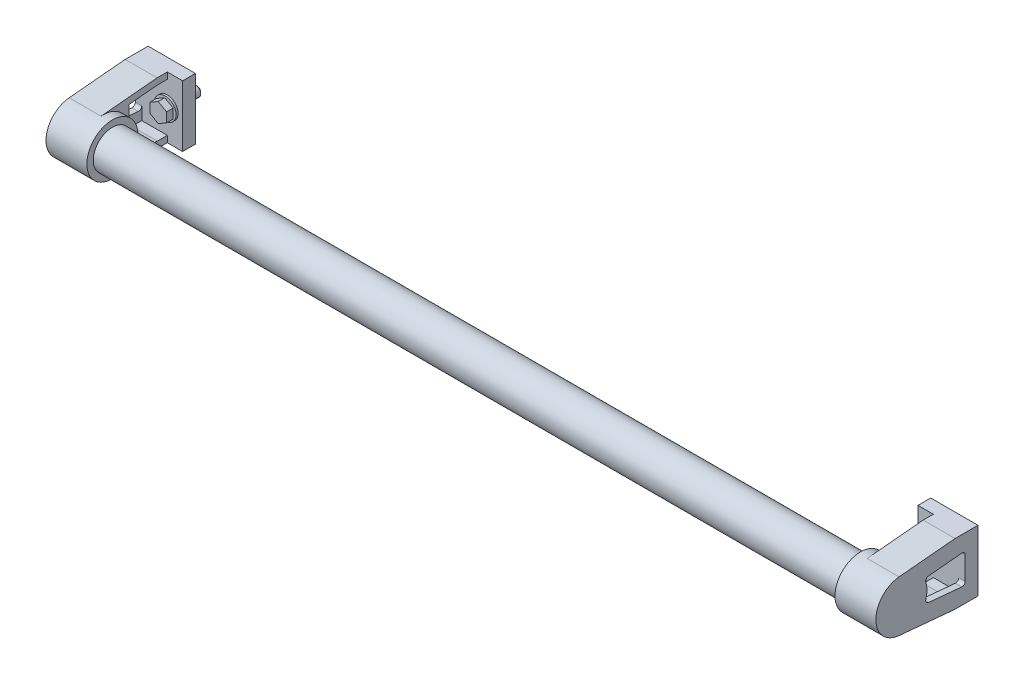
ISO-10303-21;
HEADER;
FILE_DESCRIPTION(('STEP AP214'),'2;1');
FILE_NAME('part.step','',(''),(''),'','','');
FILE_SCHEMA(('AUTOMOTIVE_DESIGN { 1 0 10303 214 1 1 1 1 }'));
ENDSEC;
DATA;
#1=APPLICATION_CONTEXT('core data for automotive mechanical design processes');
#2=APPLICATION_PROTOCOL_DEFINITION('international standard','automotive_design',2000,#1);
#3=PRODUCT_CONTEXT('',#1,'mechanical');
#4=PRODUCT('Part','Part','',(#3));
#5=PRODUCT_RELATED_PRODUCT_CATEGORY('part','',(#4));
#6=PRODUCT_DEFINITION_FORMATION('','',#4);
#7=PRODUCT_DEFINITION_CONTEXT('part definition',#1,'design');
#8=PRODUCT_DEFINITION('design','',#6,#7);
#9=PRODUCT_DEFINITION_SHAPE('','',#8);
#10=(LENGTH_UNIT() NAMED_UNIT(*) SI_UNIT(.MILLI.,.METRE.));
#11=(NAMED_UNIT(*) PLANE_ANGLE_UNIT() SI_UNIT($,.RADIAN.));
#12=(NAMED_UNIT(*) SI_UNIT($,.STERADIAN.) SOLID_ANGLE_UNIT());
#13=UNCERTAINTY_MEASURE_WITH_UNIT(LENGTH_MEASURE(1.E-05),#10,'distance_accuracy_value','');
#14=(GEOMETRIC_REPRESENTATION_CONTEXT(3) GLOBAL_UNCERTAINTY_ASSIGNED_CONTEXT((#13)) GLOBAL_UNIT_ASSIGNED_CONTEXT((#10,
#11,#12)) REPRESENTATION_CONTEXT('',''));
#15=CARTESIAN_POINT('',(0.,0.,0.));
#16=DIRECTION('',(0.,0.,1.));
#17=DIRECTION('',(1.,0.,0.));
#18=AXIS2_PLACEMENT_3D('',#15,#16,#17);
#19=CARTESIAN_POINT('',(16.,-23.9999999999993,18.0000000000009));
#20=DIRECTION('',(0.,0.995687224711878,-0.0927736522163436));
#21=DIRECTION('',(0.,0.0927736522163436,0.995687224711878));
#22=AXIS2_PLACEMENT_3D('',#19,#20,#21);
#23=PLANE('',#22);
#24=DIRECTION('',(0.,0.0927736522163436,0.995687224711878));
#25=VECTOR('',#24,1.);
#26=CARTESIAN_POINT('',(0.,-23.9999999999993,18.0000000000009));
#27=LINE('',#26,#25);
#28=CARTESIAN_POINT('',(0.,-19.9137444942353,61.8554730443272));
#29=VERTEX_POINT('',#28);
#30=CARTESIAN_POINT('',(0.,-23.9999999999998,17.999999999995));
#31=VERTEX_POINT('',#30);
#32=EDGE_CURVE('E651',#29,#31,#27,.F.);
#33=ORIENTED_EDGE('',*,*,#32,.F.);
#34=DIRECTION('',(-1.,0.,0.));
#35=VECTOR('',#34,1.);
#36=CARTESIAN_POINT('',(7.,-19.9137444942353,61.8554730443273));
#37=LINE('',#36,#35);
#38=CARTESIAN_POINT('',(-25.,-19.9137444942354,61.8554730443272));
#39=VERTEX_POINT('',#38);
#40=EDGE_CURVE('E587',#39,#29,#37,.F.);
#41=ORIENTED_EDGE('',*,*,#40,.F.);
#42=DIRECTION('',(0.,0.0927736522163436,0.995687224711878));
#43=VECTOR('',#42,1.);
#44=CARTESIAN_POINT('',(-25.,-23.9999999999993,18.0000000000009));
#45=LINE('',#44,#43);
#46=CARTESIAN_POINT('',(-25.,-24.,17.999999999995));
#47=VERTEX_POINT('',#46);
#48=EDGE_CURVE('E590',#47,#39,#45,.T.);
#49=ORIENTED_EDGE('',*,*,#48,.F.);
#50=DIRECTION('',(1.,0.,0.));
#51=VECTOR('',#50,1.);
#52=CARTESIAN_POINT('',(16.,-24.,17.999999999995));
#53=LINE('',#52,#51);
#54=EDGE_CURVE('E641',#31,#47,#53,.F.);
#55=ORIENTED_EDGE('',*,*,#54,.F.);
#56=EDGE_LOOP('',(#33,#41,#49,#55));
#57=FACE_BOUND('',#56,.T.);
#58=ADVANCED_FACE('F14',(#57),#23,.F.);
#59=CARTESIAN_POINT('',(16.,24.0000000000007,17.999999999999));
#60=DIRECTION('',(0.,0.995687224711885,0.092773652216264));
#61=DIRECTION('',(0.,-0.092773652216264,0.995687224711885));
#62=AXIS2_PLACEMENT_3D('',#59,#60,#61);
#63=PLANE('',#62);
#64=DIRECTION('',(1.,0.,0.));
#65=VECTOR('',#64,1.);
#66=CARTESIAN_POINT('',(16.,19.9137444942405,61.8554730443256));
#67=LINE('',#66,#65);
#68=CARTESIAN_POINT('',(-25.,19.9137444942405,61.8554730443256));
#69=VERTEX_POINT('',#68);
#70=CARTESIAN_POINT('',(0.,19.9137444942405,61.8554730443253));
#71=VERTEX_POINT('',#70);
#72=EDGE_CURVE('E582',#69,#71,#67,.T.);
#73=ORIENTED_EDGE('',*,*,#72,.T.);
#74=DIRECTION('',(0.,-0.092773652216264,0.995687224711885));
#75=VECTOR('',#74,1.);
#76=CARTESIAN_POINT('',(0.,24.0000000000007,17.999999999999));
#77=LINE('',#76,#75);
#78=CARTESIAN_POINT('',(0.,24.0000000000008,17.999999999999));
#79=VERTEX_POINT('',#78);
#80=EDGE_CURVE('E619',#71,#79,#77,.F.);
#81=ORIENTED_EDGE('',*,*,#80,.T.);
#82=DIRECTION('',(1.,0.,0.));
#83=VECTOR('',#82,1.);
#84=CARTESIAN_POINT('',(16.,24.0000000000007,17.999999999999));
#85=LINE('',#84,#83);
#86=CARTESIAN_POINT('',(-25.,24.0000000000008,17.999999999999));
#87=VERTEX_POINT('',#86);
#88=EDGE_CURVE('E593',#79,#87,#85,.F.);
#89=ORIENTED_EDGE('',*,*,#88,.T.);
#90=DIRECTION('',(0.,-0.092773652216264,0.995687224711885));
#91=VECTOR('',#90,1.);
#92=CARTESIAN_POINT('',(-25.,24.0000000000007,17.999999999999));
#93=LINE('',#92,#91);
#94=EDGE_CURVE('E586',#87,#69,#93,.T.);
#95=ORIENTED_EDGE('',*,*,#94,.T.);
#96=EDGE_LOOP('',(#73,#81,#89,#95));
#97=FACE_BOUND('',#96,.T.);
#98=ADVANCED_FACE('F1416',(#97),#63,.T.);
#99=CARTESIAN_POINT('',(7.,2.62290189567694E-12,60.));
#100=DIRECTION('',(-1.,0.,0.));
#101=DIRECTION('',(0.,0.,1.));
#102=AXIS2_PLACEMENT_3D('',#99,#100,#101);
#103=PLANE('',#102);
#104=CARTESIAN_POINT('',(7.,2.62290189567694E-12,60.));
#105=DIRECTION('',(1.,0.,0.));
#106=DIRECTION('',(0.,0.,-1.));
#107=AXIS2_PLACEMENT_3D('',#104,#105,#106);
#108=CIRCLE('',#107,15.);
#109=CARTESIAN_POINT('',(7.,2.62290189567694E-12,45.));
#110=VERTEX_POINT('',#109);
#111=EDGE_CURVE('E9',#110,#110,#108,.T.);
#112=ORIENTED_EDGE('',*,*,#111,.F.);
#113=EDGE_LOOP('',(#112));
#114=FACE_BOUND('',#113,.T.);
#115=CARTESIAN_POINT('',(7.,2.62290189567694E-12,60.));
#116=DIRECTION('',(-1.,0.,0.));
#117=DIRECTION('',(0.,0.,1.));
#118=AXIS2_PLACEMENT_3D('',#115,#116,#117);
#119=CIRCLE('',#118,20.0000000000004);
#120=CARTESIAN_POINT('',(7.,2.62290189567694E-12,80.0000000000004));
#121=VERTEX_POINT('',#120);
#122=EDGE_CURVE('E585',#121,#121,#119,.T.);
#123=ORIENTED_EDGE('',*,*,#122,.F.);
#124=EDGE_LOOP('',(#123));
#125=FACE_BOUND('',#124,.T.);
#126=ADVANCED_FACE('F1426',(#114,#125),#103,.F.);
#127=CARTESIAN_POINT('',(-6.5,4.9960036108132E-13,12.));
#128=DIRECTION('',(0.,0.,-1.));
#129=DIRECTION('',(0.,1.,0.));
#130=AXIS2_PLACEMENT_3D('',#127,#128,#129);
#131=PLANE('',#130);
#132=CARTESIAN_POINT('',(0.,4.99600361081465E-13,12.));
#133=DIRECTION('',(0.,0.,1.));
#134=DIRECTION('',(0.,-1.,0.));
#135=AXIS2_PLACEMENT_3D('',#132,#133,#134);
#136=CIRCLE('',#135,5.85000000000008);
#137=CARTESIAN_POINT('',(0.,-5.84999999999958,12.0000000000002));
#138=VERTEX_POINT('',#137);
#139=EDGE_CURVE('E566',#138,#138,#136,.F.);
#140=ORIENTED_EDGE('',*,*,#139,.F.);
#141=EDGE_LOOP('',(#140));
#142=FACE_BOUND('',#141,.T.);
#143=DIRECTION('',(0.866025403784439,0.5,0.));
#144=VECTOR('',#143,1.);
#145=CARTESIAN_POINT('',(0.,-7.50555349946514,12.));
#146=LINE('',#145,#144);
#147=CARTESIAN_POINT('',(0.,-7.50555349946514,12.));
#148=VERTEX_POINT('',#147);
#149=CARTESIAN_POINT('',(6.5,-3.75277674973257,12.));
#150=VERTEX_POINT('',#149);
#151=EDGE_CURVE('E1953',#148,#150,#146,.T.);
#152=ORIENTED_EDGE('',*,*,#151,.F.);
#153=DIRECTION('',(0.866025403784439,-0.5,0.));
#154=VECTOR('',#153,1.);
#155=CARTESIAN_POINT('',(-6.5,-3.75277674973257,12.));
#156=LINE('',#155,#154);
#157=CARTESIAN_POINT('',(-6.5,-3.75277674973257,12.));
#158=VERTEX_POINT('',#157);
#159=EDGE_CURVE('E1946',#158,#148,#156,.T.);
#160=ORIENTED_EDGE('',*,*,#159,.F.);
#161=DIRECTION('',(0.,-1.,0.));
#162=VECTOR('',#161,1.);
#163=CARTESIAN_POINT('',(-6.5,3.75277674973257,12.));
#164=LINE('',#163,#162);
#165=CARTESIAN_POINT('',(-6.5,3.75277674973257,12.));
#166=VERTEX_POINT('',#165);
#167=EDGE_CURVE('E1954',#166,#158,#164,.T.);
#168=ORIENTED_EDGE('',*,*,#167,.F.);
#169=DIRECTION('',(-0.866025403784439,-0.5,0.));
#170=VECTOR('',#169,1.);
#171=CARTESIAN_POINT('',(0.,7.50555349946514,12.));
#172=LINE('',#171,#170);
#173=CARTESIAN_POINT('',(0.,7.50555349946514,12.));
#174=VERTEX_POINT('',#173);
#175=EDGE_CURVE('E1959',#174,#166,#172,.T.);
#176=ORIENTED_EDGE('',*,*,#175,.F.);
#177=DIRECTION('',(-0.866025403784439,0.5,0.));
#178=VECTOR('',#177,1.);
#179=CARTESIAN_POINT('',(6.5,3.75277674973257,12.));
#180=LINE('',#179,#178);
#181=CARTESIAN_POINT('',(6.5,3.75277674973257,12.));
#182=VERTEX_POINT('',#181);
#183=EDGE_CURVE('E562',#182,#174,#180,.T.);
#184=ORIENTED_EDGE('',*,*,#183,.F.);
#185=DIRECTION('',(0.,1.,0.));
#186=VECTOR('',#185,1.);
#187=CARTESIAN_POINT('',(6.5,-3.75277674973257,12.));
#188=LINE('',#187,#186);
#189=EDGE_CURVE('E549',#150,#182,#188,.T.);
#190=ORIENTED_EDGE('',*,*,#189,.F.);
#191=EDGE_LOOP('',(#152,#160,#168,#176,#184,#190));
#192=FACE_BOUND('',#191,.T.);
#193=ADVANCED_FACE('F1692',(#142,#192),#131,.T.);
#194=CARTESIAN_POINT('',(0.,3.33066907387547E-12,80.));
#195=DIRECTION('',(0.,0.,1.));
#196=DIRECTION('',(0.,-1.,0.));
#197=AXIS2_PLACEMENT_3D('',#194,#195,#196);
#198=CYLINDRICAL_SURFACE('',#197,5.85000000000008);
#199=ORIENTED_EDGE('',*,*,#139,.T.);
#200=EDGE_LOOP('',(#199));
#201=FACE_BOUND('',#200,.T.);
#202=CARTESIAN_POINT('',(0.,4.82947015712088E-13,11.6));
#203=DIRECTION('',(0.,0.,1.));
#204=DIRECTION('',(0.,-1.,0.));
#205=AXIS2_PLACEMENT_3D('',#202,#203,#204);
#206=CIRCLE('',#205,5.85000000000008);
#207=CARTESIAN_POINT('',(0.,-5.8499999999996,11.6000000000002));
#208=VERTEX_POINT('',#207);
#209=EDGE_CURVE('E880',#208,#208,#206,.F.);
#210=ORIENTED_EDGE('',*,*,#209,.F.);
#211=EDGE_LOOP('',(#210));
#212=FACE_BOUND('',#211,.T.);
#213=ADVANCED_FACE('F1682',(#201,#212),#198,.T.);
#214=CARTESIAN_POINT('',(-5.85,4.71844785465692E-13,11.6));
#215=DIRECTION('',(0.,0.,1.));
#216=DIRECTION('',(0.,-1.,0.));
#217=AXIS2_PLACEMENT_3D('',#214,#215,#216);
#218=PLANE('',#217);
#219=CARTESIAN_POINT('',(0.,4.82947015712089E-13,11.6));
#220=DIRECTION('',(0.,0.,1.));
#221=DIRECTION('',(0.,-1.,0.));
#222=AXIS2_PLACEMENT_3D('',#219,#220,#221);
#223=CIRCLE('',#222,8.50000000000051);
#224=CARTESIAN_POINT('',(0.,-8.50000000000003,11.6000000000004));
#225=VERTEX_POINT('',#224);
#226=EDGE_CURVE('E827',#225,#225,#223,.F.);
#227=ORIENTED_EDGE('',*,*,#226,.F.);
#228=EDGE_LOOP('',(#227));
#229=FACE_BOUND('',#228,.T.);
#230=ORIENTED_EDGE('',*,*,#209,.T.);
#231=EDGE_LOOP('',(#230));
#232=FACE_BOUND('',#231,.T.);
#233=ADVANCED_FACE('F1672',(#229,#232),#218,.T.);
#234=CARTESIAN_POINT('',(0.,5.27355936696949E-13,12.7319341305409));
#235=DIRECTION('',(0.,0.,1.));
#236=DIRECTION('',(0.,-1.,0.));
#237=AXIS2_PLACEMENT_3D('',#234,#235,#236);
#238=CYLINDRICAL_SURFACE('',#237,3.99999999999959);
#239=CARTESIAN_POINT('',(0.,-5.10644337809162E-13,-12.2));
#240=DIRECTION('',(0.,0.,1.));
#241=DIRECTION('',(0.,-1.,0.));
#242=AXIS2_PLACEMENT_3D('',#239,#240,#241);
#243=CIRCLE('',#242,3.99999999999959);
#244=CARTESIAN_POINT('',(0.,-4.0000000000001,-12.1999999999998));
#245=VERTEX_POINT('',#244);
#246=EDGE_CURVE('E851',#245,#245,#243,.T.);
#247=ORIENTED_EDGE('',*,*,#246,.T.);
#248=EDGE_LOOP('',(#247));
#249=FACE_BOUND('',#248,.T.);
#250=CARTESIAN_POINT('',(0.,0.,0.));
#251=DIRECTION('',(0.,0.,1.));
#252=DIRECTION('',(0.,-1.,0.));
#253=AXIS2_PLACEMENT_3D('',#250,#251,#252);
#254=CIRCLE('',#253,3.99999999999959);
#255=CARTESIAN_POINT('',(0.,-3.99999999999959,1.1102230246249E-13));
#256=VERTEX_POINT('',#255);
#257=EDGE_CURVE('E722',#256,#256,#254,.T.);
#258=ORIENTED_EDGE('',*,*,#257,.F.);
#259=EDGE_LOOP('',(#258));
#260=FACE_BOUND('',#259,.T.);
#261=ADVANCED_FACE('F1662',(#249,#260),#238,.T.);
#262=CARTESIAN_POINT('',(0.,3.33066907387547E-12,80.));
#263=DIRECTION('',(0.,0.,1.));
#264=DIRECTION('',(0.,-1.,0.));
#265=AXIS2_PLACEMENT_3D('',#262,#263,#264);
#266=CYLINDRICAL_SURFACE('',#265,8.50000000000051);
#267=ORIENTED_EDGE('',*,*,#226,.T.);
#268=EDGE_LOOP('',(#267));
#269=FACE_BOUND('',#268,.T.);
#270=CARTESIAN_POINT('',(0.,4.16333634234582E-13,10.));
#271=DIRECTION('',(0.,0.,1.));
#272=DIRECTION('',(0.,-1.,0.));
#273=AXIS2_PLACEMENT_3D('',#270,#271,#272);
#274=CIRCLE('',#273,8.50000000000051);
#275=CARTESIAN_POINT('',(0.,-8.50000000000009,10.0000000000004));
#276=VERTEX_POINT('',#275);
#277=EDGE_CURVE('E688',#276,#276,#274,.T.);
#278=ORIENTED_EDGE('',*,*,#277,.T.);
#279=EDGE_LOOP('',(#278));
#280=FACE_BOUND('',#279,.T.);
#281=ADVANCED_FACE('F1652',(#269,#280),#266,.T.);
#282=CARTESIAN_POINT('',(-20.,-18.9999999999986,40.0000000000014));
#283=DIRECTION('',(1.,0.,0.));
#284=DIRECTION('',(0.,0.,-1.));
#285=AXIS2_PLACEMENT_3D('',#282,#283,#284);
#286=PLANE('',#285);
#287=DIRECTION('',(0.,1.,0.));
#288=VECTOR('',#287,1.);
#289=CARTESIAN_POINT('',(-20.,-23.9999999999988,40.0000000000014));
#290=LINE('',#289,#288);
#291=CARTESIAN_POINT('',(-20.,-16.9284817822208,40.0000000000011));
#292=VERTEX_POINT('',#291);
#293=CARTESIAN_POINT('',(-20.,-8.50076165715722,40.0000000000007));
#294=VERTEX_POINT('',#293);
#295=EDGE_CURVE('E792',#292,#294,#290,.T.);
#296=ORIENTED_EDGE('',*,*,#295,.F.);
#297=DIRECTION('',(0.,-0.0927736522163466,-0.995687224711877));
#298=VECTOR('',#297,1.);
#299=CARTESIAN_POINT('',(-20.,-18.9999999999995,17.7675646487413));
#300=LINE('',#299,#298);
#301=CARTESIAN_POINT('',(-20.,-18.9999999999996,17.7675646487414));
#302=VERTEX_POINT('',#301);
#303=EDGE_CURVE('E802',#292,#302,#300,.T.);
#304=ORIENTED_EDGE('',*,*,#303,.T.);
#305=DIRECTION('',(0.,0.,-1.));
#306=VECTOR('',#305,1.);
#307=CARTESIAN_POINT('',(-20.,-19.,10.0000000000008));
#308=LINE('',#307,#306);
#309=CARTESIAN_POINT('',(-20.,-19.,10.0000000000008));
#310=VERTEX_POINT('',#309);
#311=EDGE_CURVE('E824',#302,#310,#308,.T.);
#312=ORIENTED_EDGE('',*,*,#311,.T.);
#313=DIRECTION('',(0.,1.,0.));
#314=VECTOR('',#313,1.);
#315=CARTESIAN_POINT('',(-20.,-8.94532766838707,10.0000000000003));
#316=LINE('',#315,#314);
#317=CARTESIAN_POINT('',(-20.,-8.94532766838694,10.0000000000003));
#318=VERTEX_POINT('',#317);
#319=EDGE_CURVE('E682',#310,#318,#316,.T.);
#320=ORIENTED_EDGE('',*,*,#319,.T.);
#321=CARTESIAN_POINT('',(-20.,-8.94532766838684,12.5000000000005));
#322=DIRECTION('',(-1.,0.,0.));
#323=DIRECTION('',(0.,0.,1.));
#324=AXIS2_PLACEMENT_3D('',#321,#322,#323);
#325=CIRCLE('',#324,2.5);
#326=CARTESIAN_POINT('',(-20.,-11.4345457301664,12.7319341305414));
#327=VERTEX_POINT('',#326);
#328=EDGE_CURVE('E689',#318,#327,#325,.T.);
#329=ORIENTED_EDGE('',*,*,#328,.T.);
#330=DIRECTION('',(0.,0.0927736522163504,0.995687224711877));
#331=VECTOR('',#330,1.);
#332=CARTESIAN_POINT('',(-20.,-11.4345457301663,12.7319341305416));
#333=LINE('',#332,#331);
#334=CARTESIAN_POINT('',(-20.,-9.01504355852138,38.6990847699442));
#335=VERTEX_POINT('',#334);
#336=EDGE_CURVE('E693',#335,#327,#333,.F.);
#337=ORIENTED_EDGE('',*,*,#336,.F.);
#338=CARTESIAN_POINT('',(-20.,-6.52582549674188,38.4671506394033));
#339=DIRECTION('',(-1.,0.,0.));
#340=DIRECTION('',(0.,0.,1.));
#341=AXIS2_PLACEMENT_3D('',#338,#339,#340);
#342=CIRCLE('',#341,2.5);
#343=EDGE_CURVE('E698',#335,#294,#342,.T.);
#344=ORIENTED_EDGE('',*,*,#343,.T.);
#345=EDGE_LOOP('',(#296,#304,#312,#320,#329,#337,#344));
#346=FACE_BOUND('',#345,.T.);
#347=ADVANCED_FACE('F1642',(#346),#286,.T.);
#348=CARTESIAN_POINT('',(-20.,-18.9999999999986,40.0000000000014));
#349=DIRECTION('',(1.,0.,0.));
#350=DIRECTION('',(0.,0.,-1.));
#351=AXIS2_PLACEMENT_3D('',#348,#349,#350);
#352=PLANE('',#351);
#353=DIRECTION('',(0.,1.,0.));
#354=VECTOR('',#353,1.);
#355=CARTESIAN_POINT('',(-20.,-8.94532766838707,10.0000000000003));
#356=LINE('',#355,#354);
#357=CARTESIAN_POINT('',(-20.,8.94532766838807,9.99999999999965));
#358=VERTEX_POINT('',#357);
#359=CARTESIAN_POINT('',(-20.,19.0000000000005,9.99999999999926));
#360=VERTEX_POINT('',#359);
#361=EDGE_CURVE('E685',#358,#360,#356,.T.);
#362=ORIENTED_EDGE('',*,*,#361,.T.);
#363=DIRECTION('',(0.,0.,-1.));
#364=VECTOR('',#363,1.);
#365=CARTESIAN_POINT('',(-20.,19.0000000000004,9.99999999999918));
#366=LINE('',#365,#364);
#367=CARTESIAN_POINT('',(-20.,19.0000000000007,17.7675646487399));
#368=VERTEX_POINT('',#367);
#369=EDGE_CURVE('E760',#368,#360,#366,.T.);
#370=ORIENTED_EDGE('',*,*,#369,.F.);
#371=DIRECTION('',(0.,0.0927736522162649,-0.995687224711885));
#372=VECTOR('',#371,1.);
#373=CARTESIAN_POINT('',(-20.,19.0000000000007,17.7675646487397));
#374=LINE('',#373,#372);
#375=CARTESIAN_POINT('',(-20.,16.9284817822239,40.));
#376=VERTEX_POINT('',#375);
#377=EDGE_CURVE('E761',#376,#368,#374,.T.);
#378=ORIENTED_EDGE('',*,*,#377,.F.);
#379=DIRECTION('',(0.,1.,0.));
#380=VECTOR('',#379,1.);
#381=CARTESIAN_POINT('',(-20.,-23.9999999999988,40.0000000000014));
#382=LINE('',#381,#380);
#383=CARTESIAN_POINT('',(-20.,8.50076165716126,40.));
#384=VERTEX_POINT('',#383);
#385=EDGE_CURVE('E771',#384,#376,#382,.T.);
#386=ORIENTED_EDGE('',*,*,#385,.F.);
#387=CARTESIAN_POINT('',(-20.,6.52582549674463,38.4671506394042));
#388=DIRECTION('',(-1.,0.,0.));
#389=DIRECTION('',(0.,0.,1.));
#390=AXIS2_PLACEMENT_3D('',#387,#388,#389);
#391=CIRCLE('',#390,2.5);
#392=CARTESIAN_POINT('',(-20.,9.01504355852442,38.699084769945));
#393=VERTEX_POINT('',#392);
#394=EDGE_CURVE('E699',#384,#393,#391,.T.);
#395=ORIENTED_EDGE('',*,*,#394,.T.);
#396=DIRECTION('',(0.,-0.0927736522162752,0.995687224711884));
#397=VECTOR('',#396,1.);
#398=CARTESIAN_POINT('',(-20.,11.4345457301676,12.7319341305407));
#399=LINE('',#398,#397);
#400=CARTESIAN_POINT('',(-20.,11.4345457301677,12.7319341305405));
#401=VERTEX_POINT('',#400);
#402=EDGE_CURVE('E703',#393,#401,#399,.F.);
#403=ORIENTED_EDGE('',*,*,#402,.T.);
#404=CARTESIAN_POINT('',(-20.,8.94532766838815,12.4999999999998));
#405=DIRECTION('',(-1.,0.,0.));
#406=DIRECTION('',(0.,0.,1.));
#407=AXIS2_PLACEMENT_3D('',#404,#405,#406);
#408=CIRCLE('',#407,2.5);
#409=EDGE_CURVE('E721',#401,#358,#408,.T.);
#410=ORIENTED_EDGE('',*,*,#409,.T.);
#411=EDGE_LOOP('',(#362,#370,#378,#386,#395,#403,#410));
#412=FACE_BOUND('',#411,.T.);
#413=ADVANCED_FACE('F1632',(#412),#352,.T.);
#414=CARTESIAN_POINT('',(-11.,-19.,10.0000000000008));
#415=DIRECTION('',(0.,-1.,0.));
#416=DIRECTION('',(0.,0.,-1.));
#417=AXIS2_PLACEMENT_3D('',#414,#415,#416);
#418=PLANE('',#417);
#419=ORIENTED_EDGE('',*,*,#311,.F.);
#420=DIRECTION('',(1.,0.,0.));
#421=VECTOR('',#420,1.);
#422=CARTESIAN_POINT('',(-11.,-18.9999999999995,17.7675646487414));
#423=LINE('',#422,#421);
#424=CARTESIAN_POINT('',(0.,-19.,17.7675646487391));
#425=VERTEX_POINT('',#424);
#426=EDGE_CURVE('E793',#302,#425,#423,.T.);
#427=ORIENTED_EDGE('',*,*,#426,.T.);
#428=DIRECTION('',(0.,0.,-1.));
#429=VECTOR('',#428,1.);
#430=CARTESIAN_POINT('',(0.,-19.,38.4671506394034));
#431=LINE('',#430,#429);
#432=CARTESIAN_POINT('',(0.,-19.,10.0000000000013));
#433=VERTEX_POINT('',#432);
#434=EDGE_CURVE('E776',#433,#425,#431,.F.);
#435=ORIENTED_EDGE('',*,*,#434,.F.);
#436=DIRECTION('',(1.,0.,0.));
#437=VECTOR('',#436,1.);
#438=CARTESIAN_POINT('',(16.,-19.,10.0000000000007));
#439=LINE('',#438,#437);
#440=EDGE_CURVE('E736',#433,#310,#439,.F.);
#441=ORIENTED_EDGE('',*,*,#440,.T.);
#442=EDGE_LOOP('',(#419,#427,#435,#441));
#443=FACE_BOUND('',#442,.T.);
#444=ADVANCED_FACE('F1622',(#443),#418,.F.);
#445=CARTESIAN_POINT('',(-11.,-18.9999999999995,17.7675646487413));
#446=DIRECTION('',(0.,-0.995687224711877,0.0927736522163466));
#447=DIRECTION('',(0.,-0.0927736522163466,-0.995687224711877));
#448=AXIS2_PLACEMENT_3D('',#445,#446,#447);
#449=PLANE('',#448);
#450=ORIENTED_EDGE('',*,*,#303,.F.);
#451=DIRECTION('',(1.,0.,0.));
#452=VECTOR('',#451,1.);
#453=CARTESIAN_POINT('',(3.99999999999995,-16.9284817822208,40.0000000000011));
#454=LINE('',#453,#452);
#455=CARTESIAN_POINT('',(0.,-16.9284817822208,40.0000000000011));
#456=VERTEX_POINT('',#455);
#457=EDGE_CURVE('E789',#456,#292,#454,.F.);
#458=ORIENTED_EDGE('',*,*,#457,.F.);
#459=DIRECTION('',(0.,0.0927736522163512,0.995687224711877));
#460=VECTOR('',#459,1.);
#461=CARTESIAN_POINT('',(0.,-18.9999999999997,17.7675646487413));
#462=LINE('',#461,#460);
#463=EDGE_CURVE('E669',#425,#456,#462,.T.);
#464=ORIENTED_EDGE('',*,*,#463,.F.);
#465=ORIENTED_EDGE('',*,*,#426,.F.);
#466=EDGE_LOOP('',(#450,#458,#464,#465));
#467=FACE_BOUND('',#466,.T.);
#468=ADVANCED_FACE('F1612',(#467),#449,.F.);
#469=CARTESIAN_POINT('',(3.99999999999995,-23.9999999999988,40.0000000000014));
#470=DIRECTION('',(0.,0.,-1.));
#471=DIRECTION('',(0.,1.,0.));
#472=AXIS2_PLACEMENT_3D('',#469,#470,#471);
#473=PLANE('',#472);
#474=ORIENTED_EDGE('',*,*,#457,.T.);
#475=ORIENTED_EDGE('',*,*,#295,.T.);
#476=DIRECTION('',(-1.,0.,0.));
#477=VECTOR('',#476,1.);
#478=CARTESIAN_POINT('',(16.,-8.50076165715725,40.0000000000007));
#479=LINE('',#478,#477);
#480=CARTESIAN_POINT('',(0.,-8.50076165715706,40.0000000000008));
#481=VERTEX_POINT('',#480);
#482=EDGE_CURVE('E694',#294,#481,#479,.F.);
#483=ORIENTED_EDGE('',*,*,#482,.T.);
#484=DIRECTION('',(0.,1.,0.));
#485=VECTOR('',#484,1.);
#486=CARTESIAN_POINT('',(0.,-6.52582549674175,40.0000000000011));
#487=LINE('',#486,#485);
#488=EDGE_CURVE('E665',#456,#481,#487,.T.);
#489=ORIENTED_EDGE('',*,*,#488,.F.);
#490=EDGE_LOOP('',(#474,#475,#483,#489));
#491=FACE_BOUND('',#490,.T.);
#492=ADVANCED_FACE('F1602',(#491),#473,.T.);
#493=CARTESIAN_POINT('',(3.99999999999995,-23.9999999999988,40.0000000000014));
#494=DIRECTION('',(0.,0.,-1.));
#495=DIRECTION('',(0.,1.,0.));
#496=AXIS2_PLACEMENT_3D('',#493,#494,#495);
#497=PLANE('',#496);
#498=DIRECTION('',(-1.,0.,0.));
#499=VECTOR('',#498,1.);
#500=CARTESIAN_POINT('',(16.,8.50076165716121,40.));
#501=LINE('',#500,#499);
#502=CARTESIAN_POINT('',(0.,8.50076165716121,40.));
#503=VERTEX_POINT('',#502);
#504=EDGE_CURVE('E702',#503,#384,#501,.T.);
#505=ORIENTED_EDGE('',*,*,#504,.T.);
#506=ORIENTED_EDGE('',*,*,#385,.T.);
#507=DIRECTION('',(1.,0.,0.));
#508=VECTOR('',#507,1.);
#509=CARTESIAN_POINT('',(-11.,16.9284817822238,40.));
#510=LINE('',#509,#508);
#511=CARTESIAN_POINT('',(0.,16.9284817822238,40.));
#512=VERTEX_POINT('',#511);
#513=EDGE_CURVE('E768',#512,#376,#510,.F.);
#514=ORIENTED_EDGE('',*,*,#513,.F.);
#515=DIRECTION('',(0.,1.,0.));
#516=VECTOR('',#515,1.);
#517=CARTESIAN_POINT('',(0.,2.62290189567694E-12,40.));
#518=LINE('',#517,#516);
#519=EDGE_CURVE('E633',#503,#512,#518,.T.);
#520=ORIENTED_EDGE('',*,*,#519,.F.);
#521=EDGE_LOOP('',(#505,#506,#514,#520));
#522=FACE_BOUND('',#521,.T.);
#523=ADVANCED_FACE('F1592',(#522),#497,.T.);
#524=CARTESIAN_POINT('',(-11.,19.0000000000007,17.7675646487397));
#525=DIRECTION('',(0.,-0.995687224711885,-0.0927736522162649));
#526=DIRECTION('',(0.,0.0927736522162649,-0.995687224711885));
#527=AXIS2_PLACEMENT_3D('',#524,#525,#526);
#528=PLANE('',#527);
#529=DIRECTION('',(1.,0.,0.));
#530=VECTOR('',#529,1.);
#531=CARTESIAN_POINT('',(-11.,19.0000000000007,17.7675646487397));
#532=LINE('',#531,#530);
#533=CARTESIAN_POINT('',(0.,19.0000000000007,17.7675646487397));
#534=VERTEX_POINT('',#533);
#535=EDGE_CURVE('E757',#534,#368,#532,.F.);
#536=ORIENTED_EDGE('',*,*,#535,.F.);
#537=DIRECTION('',(0.,0.0927736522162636,-0.995687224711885));
#538=VECTOR('',#537,1.);
#539=CARTESIAN_POINT('',(0.,16.9284817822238,40.));
#540=LINE('',#539,#538);
#541=EDGE_CURVE('E636',#512,#534,#540,.T.);
#542=ORIENTED_EDGE('',*,*,#541,.F.);
#543=ORIENTED_EDGE('',*,*,#513,.T.);
#544=ORIENTED_EDGE('',*,*,#377,.T.);
#545=EDGE_LOOP('',(#536,#542,#543,#544));
#546=FACE_BOUND('',#545,.T.);
#547=ADVANCED_FACE('F1582',(#546),#528,.T.);
#548=CARTESIAN_POINT('',(-11.,19.0000000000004,9.99999999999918));
#549=DIRECTION('',(0.,-1.,0.));
#550=DIRECTION('',(0.,0.,-1.));
#551=AXIS2_PLACEMENT_3D('',#548,#549,#550);
#552=PLANE('',#551);
#553=DIRECTION('',(1.,0.,0.));
#554=VECTOR('',#553,1.);
#555=CARTESIAN_POINT('',(16.,19.0000000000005,9.99999999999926));
#556=LINE('',#555,#554);
#557=CARTESIAN_POINT('',(0.,19.0000000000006,9.99999999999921));
#558=VERTEX_POINT('',#557);
#559=EDGE_CURVE('E747',#360,#558,#556,.T.);
#560=ORIENTED_EDGE('',*,*,#559,.T.);
#561=DIRECTION('',(0.,0.,-1.));
#562=VECTOR('',#561,1.);
#563=CARTESIAN_POINT('',(0.,19.0000000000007,60.));
#564=LINE('',#563,#562);
#565=EDGE_CURVE('E742',#534,#558,#564,.T.);
#566=ORIENTED_EDGE('',*,*,#565,.F.);
#567=ORIENTED_EDGE('',*,*,#535,.T.);
#568=ORIENTED_EDGE('',*,*,#369,.T.);
#569=EDGE_LOOP('',(#560,#566,#567,#568));
#570=FACE_BOUND('',#569,.T.);
#571=ADVANCED_FACE('F1572',(#570),#552,.T.);
#572=CARTESIAN_POINT('',(12.,-24.,10.0000000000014));
#573=DIRECTION('',(1.,0.,0.));
#574=DIRECTION('',(0.,0.,-1.));
#575=AXIS2_PLACEMENT_3D('',#572,#573,#574);
#576=PLANE('',#575);
#577=DIRECTION('',(0.,1.,0.));
#578=VECTOR('',#577,1.);
#579=CARTESIAN_POINT('',(12.,-24.0000000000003,9.43689570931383E-13));
#580=LINE('',#579,#578);
#581=CARTESIAN_POINT('',(12.,24.,-1.0177044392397E-12));
#582=VERTEX_POINT('',#581);
#583=CARTESIAN_POINT('',(12.,-24.0000000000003,9.43689570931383E-13));
#584=VERTEX_POINT('',#583);
#585=EDGE_CURVE('E718',#582,#584,#580,.F.);
#586=ORIENTED_EDGE('',*,*,#585,.F.);
#587=DIRECTION('',(0.,0.,1.));
#588=VECTOR('',#587,1.);
#589=CARTESIAN_POINT('',(12.,24.,-1.0547118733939E-12));
#590=LINE('',#589,#588);
#591=CARTESIAN_POINT('',(12.,24.0000000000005,9.99999999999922));
#592=VERTEX_POINT('',#591);
#593=EDGE_CURVE('E706',#592,#582,#590,.F.);
#594=ORIENTED_EDGE('',*,*,#593,.F.);
#595=DIRECTION('',(0.,1.,0.));
#596=VECTOR('',#595,1.);
#597=CARTESIAN_POINT('',(12.,-8.94532766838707,10.0000000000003));
#598=LINE('',#597,#596);
#599=CARTESIAN_POINT('',(12.,-24.,10.0000000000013));
#600=VERTEX_POINT('',#599);
#601=EDGE_CURVE('E733',#592,#600,#598,.F.);
#602=ORIENTED_EDGE('',*,*,#601,.T.);
#603=DIRECTION('',(0.,0.,1.));
#604=VECTOR('',#603,1.);
#605=CARTESIAN_POINT('',(12.,-24.0000000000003,9.43689570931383E-13));
#606=LINE('',#605,#604);
#607=EDGE_CURVE('E715',#600,#584,#606,.F.);
#608=ORIENTED_EDGE('',*,*,#607,.T.);
#609=EDGE_LOOP('',(#586,#594,#602,#608));
#610=FACE_BOUND('',#609,.T.);
#611=ADVANCED_FACE('F1562',(#610),#576,.T.);
#612=CARTESIAN_POINT('',(16.,-24.0000000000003,9.43689570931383E-13));
#613=DIRECTION('',(0.,0.,-1.));
#614=DIRECTION('',(0.,1.,0.));
#615=AXIS2_PLACEMENT_3D('',#612,#613,#614);
#616=PLANE('',#615);
#617=DIRECTION('',(1.,0.,0.));
#618=VECTOR('',#617,1.);
#619=CARTESIAN_POINT('',(16.,-24.0000000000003,9.43689570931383E-13));
#620=LINE('',#619,#618);
#621=CARTESIAN_POINT('',(-25.,-24.0000000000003,-3.88578058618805E-13));
#622=VERTEX_POINT('',#621);
#623=EDGE_CURVE('E657',#584,#622,#620,.F.);
#624=ORIENTED_EDGE('',*,*,#623,.T.);
#625=DIRECTION('',(0.,1.,0.));
#626=VECTOR('',#625,1.);
#627=CARTESIAN_POINT('',(-25.,2.62290189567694E-12,-1.0547118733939E-12));
#628=LINE('',#627,#626);
#629=CARTESIAN_POINT('',(-25.,24.0000000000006,-1.0547118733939E-12));
#630=VERTEX_POINT('',#629);
#631=EDGE_CURVE('E613',#630,#622,#628,.F.);
#632=ORIENTED_EDGE('',*,*,#631,.F.);
#633=DIRECTION('',(1.,0.,0.));
#634=VECTOR('',#633,1.);
#635=CARTESIAN_POINT('',(16.,24.,-1.0547118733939E-12));
#636=LINE('',#635,#634);
#637=EDGE_CURVE('E646',#582,#630,#636,.F.);
#638=ORIENTED_EDGE('',*,*,#637,.F.);
#639=ORIENTED_EDGE('',*,*,#585,.T.);
#640=EDGE_LOOP('',(#624,#632,#638,#639));
#641=FACE_BOUND('',#640,.T.);
#642=ORIENTED_EDGE('',*,*,#257,.T.);
#643=EDGE_LOOP('',(#642));
#644=FACE_BOUND('',#643,.T.);
#645=ADVANCED_FACE('F1552',(#641,#644),#616,.T.);
#646=CARTESIAN_POINT('',(7.,8.94532766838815,12.4999999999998));
#647=DIRECTION('',(-1.,0.,0.));
#648=DIRECTION('',(0.,0.,1.));
#649=AXIS2_PLACEMENT_3D('',#646,#647,#648);
#650=CYLINDRICAL_SURFACE('',#649,2.5);
#651=DIRECTION('',(1.,0.,0.));
#652=VECTOR('',#651,1.);
#653=CARTESIAN_POINT('',(7.,11.4345457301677,12.7319341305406));
#654=LINE('',#653,#652);
#655=CARTESIAN_POINT('',(-25.,11.4345457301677,12.7319341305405));
#656=VERTEX_POINT('',#655);
#657=EDGE_CURVE('E700',#401,#656,#654,.F.);
#658=ORIENTED_EDGE('',*,*,#657,.T.);
#659=CARTESIAN_POINT('',(-25.,8.94532766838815,12.4999999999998));
#660=DIRECTION('',(-1.,0.,0.));
#661=DIRECTION('',(0.,0.,1.));
#662=AXIS2_PLACEMENT_3D('',#659,#660,#661);
#663=CIRCLE('',#662,2.5);
#664=CARTESIAN_POINT('',(-25.,8.94532766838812,10.));
#665=VERTEX_POINT('',#664);
#666=EDGE_CURVE('E609',#665,#656,#663,.F.);
#667=ORIENTED_EDGE('',*,*,#666,.F.);
#668=DIRECTION('',(1.,0.,0.));
#669=VECTOR('',#668,1.);
#670=CARTESIAN_POINT('',(16.,8.94532766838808,9.99999999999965));
#671=LINE('',#670,#669);
#672=EDGE_CURVE('E681',#665,#358,#671,.T.);
#673=ORIENTED_EDGE('',*,*,#672,.T.);
#674=ORIENTED_EDGE('',*,*,#409,.F.);
#675=EDGE_LOOP('',(#658,#667,#673,#674));
#676=FACE_BOUND('',#675,.T.);
#677=ADVANCED_FACE('F1542',(#676),#650,.F.);
#678=CARTESIAN_POINT('',(7.,11.4345457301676,12.7319341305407));
#679=DIRECTION('',(0.,0.995687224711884,0.0927736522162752));
#680=DIRECTION('',(0.,-0.0927736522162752,0.995687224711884));
#681=AXIS2_PLACEMENT_3D('',#678,#679,#680);
#682=PLANE('',#681);
#683=DIRECTION('',(0.,-0.0927736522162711,0.995687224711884));
#684=VECTOR('',#683,1.);
#685=CARTESIAN_POINT('',(-25.,11.4345457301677,12.7319341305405));
#686=LINE('',#685,#684);
#687=CARTESIAN_POINT('',(-25.,9.01504355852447,38.699084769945));
#688=VERTEX_POINT('',#687);
#689=EDGE_CURVE('E605',#656,#688,#686,.T.);
#690=ORIENTED_EDGE('',*,*,#689,.F.);
#691=ORIENTED_EDGE('',*,*,#657,.F.);
#692=ORIENTED_EDGE('',*,*,#402,.F.);
#693=DIRECTION('',(-1.,0.,0.));
#694=VECTOR('',#693,1.);
#695=CARTESIAN_POINT('',(16.,9.01504355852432,38.6990847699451));
#696=LINE('',#695,#694);
#697=EDGE_CURVE('E695',#393,#688,#696,.T.);
#698=ORIENTED_EDGE('',*,*,#697,.T.);
#699=EDGE_LOOP('',(#690,#691,#692,#698));
#700=FACE_BOUND('',#699,.T.);
#701=ADVANCED_FACE('F1532',(#700),#682,.F.);
#702=CARTESIAN_POINT('',(7.,-11.4345457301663,12.7319341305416));
#703=DIRECTION('',(0.,0.995687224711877,-0.0927736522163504));
#704=DIRECTION('',(0.,0.0927736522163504,0.995687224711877));
#705=AXIS2_PLACEMENT_3D('',#702,#703,#704);
#706=PLANE('',#705);
#707=DIRECTION('',(-1.,0.,0.));
#708=VECTOR('',#707,1.);
#709=CARTESIAN_POINT('',(7.,-11.4345457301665,12.7319341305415));
#710=LINE('',#709,#708);
#711=CARTESIAN_POINT('',(-25.,-11.4345457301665,12.7319341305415));
#712=VERTEX_POINT('',#711);
#713=EDGE_CURVE('E686',#327,#712,#710,.T.);
#714=ORIENTED_EDGE('',*,*,#713,.T.);
#715=DIRECTION('',(0.,-0.0927736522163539,-0.995687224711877));
#716=VECTOR('',#715,1.);
#717=CARTESIAN_POINT('',(-25.,-9.01504355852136,38.6990847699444));
#718=LINE('',#717,#716);
#719=CARTESIAN_POINT('',(-25.,-9.01504355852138,38.6990847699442));
#720=VERTEX_POINT('',#719);
#721=EDGE_CURVE('E601',#720,#712,#718,.T.);
#722=ORIENTED_EDGE('',*,*,#721,.F.);
#723=DIRECTION('',(1.,0.,0.));
#724=VECTOR('',#723,1.);
#725=CARTESIAN_POINT('',(7.,-9.01504355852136,38.6990847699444));
#726=LINE('',#725,#724);
#727=EDGE_CURVE('E690',#720,#335,#726,.T.);
#728=ORIENTED_EDGE('',*,*,#727,.T.);
#729=ORIENTED_EDGE('',*,*,#336,.T.);
#730=EDGE_LOOP('',(#714,#722,#728,#729));
#731=FACE_BOUND('',#730,.T.);
#732=ADVANCED_FACE('F1522',(#731),#706,.T.);
#733=CARTESIAN_POINT('',(7.,-8.94532766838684,12.5000000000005));
#734=DIRECTION('',(-1.,0.,0.));
#735=DIRECTION('',(0.,0.,1.));
#736=AXIS2_PLACEMENT_3D('',#733,#734,#735);
#737=CYLINDRICAL_SURFACE('',#736,2.5);
#738=CARTESIAN_POINT('',(-25.,-8.94532766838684,12.5000000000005));
#739=DIRECTION('',(-1.,0.,0.));
#740=DIRECTION('',(0.,0.,1.));
#741=AXIS2_PLACEMENT_3D('',#738,#739,#740);
#742=CIRCLE('',#741,2.5);
#743=CARTESIAN_POINT('',(-25.,-8.94532766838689,10.0000000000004));
#744=VERTEX_POINT('',#743);
#745=EDGE_CURVE('E600',#712,#744,#742,.F.);
#746=ORIENTED_EDGE('',*,*,#745,.F.);
#747=ORIENTED_EDGE('',*,*,#713,.F.);
#748=ORIENTED_EDGE('',*,*,#328,.F.);
#749=DIRECTION('',(1.,0.,0.));
#750=VECTOR('',#749,1.);
#751=CARTESIAN_POINT('',(16.,-8.94532766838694,10.0000000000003));
#752=LINE('',#751,#750);
#753=EDGE_CURVE('E679',#318,#744,#752,.F.);
#754=ORIENTED_EDGE('',*,*,#753,.T.);
#755=EDGE_LOOP('',(#746,#747,#748,#754));
#756=FACE_BOUND('',#755,.T.);
#757=ADVANCED_FACE('F1512',(#756),#737,.F.);
#758=CARTESIAN_POINT('',(16.,-8.94532766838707,10.0000000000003));
#759=DIRECTION('',(0.,0.,-1.));
#760=DIRECTION('',(0.,1.,0.));
#761=AXIS2_PLACEMENT_3D('',#758,#759,#760);
#762=PLANE('',#761);
#763=ORIENTED_EDGE('',*,*,#559,.F.);
#764=ORIENTED_EDGE('',*,*,#361,.F.);
#765=ORIENTED_EDGE('',*,*,#672,.F.);
#766=DIRECTION('',(0.,1.,0.));
#767=VECTOR('',#766,1.);
#768=CARTESIAN_POINT('',(-25.,2.62290189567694E-12,10.0000000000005));
#769=LINE('',#768,#767);
#770=EDGE_CURVE('E596',#744,#665,#769,.T.);
#771=ORIENTED_EDGE('',*,*,#770,.F.);
#772=ORIENTED_EDGE('',*,*,#753,.F.);
#773=ORIENTED_EDGE('',*,*,#319,.F.);
#774=ORIENTED_EDGE('',*,*,#440,.F.);
#775=DIRECTION('',(0.,1.,0.));
#776=VECTOR('',#775,1.);
#777=CARTESIAN_POINT('',(0.,-6.52582549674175,10.0000000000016));
#778=LINE('',#777,#776);
#779=CARTESIAN_POINT('',(0.,-24.,10.0000000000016));
#780=VERTEX_POINT('',#779);
#781=EDGE_CURVE('E750',#780,#433,#778,.T.);
#782=ORIENTED_EDGE('',*,*,#781,.F.);
#783=DIRECTION('',(1.,0.,0.));
#784=VECTOR('',#783,1.);
#785=CARTESIAN_POINT('',(16.,-24.,10.0000000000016));
#786=LINE('',#785,#784);
#787=EDGE_CURVE('E637',#780,#600,#786,.T.);
#788=ORIENTED_EDGE('',*,*,#787,.T.);
#789=ORIENTED_EDGE('',*,*,#601,.F.);
#790=DIRECTION('',(1.,0.,0.));
#791=VECTOR('',#790,1.);
#792=CARTESIAN_POINT('',(16.,24.0000000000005,9.9999999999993));
#793=LINE('',#792,#791);
#794=CARTESIAN_POINT('',(0.,24.0000000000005,9.99999999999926));
#795=VERTEX_POINT('',#794);
#796=EDGE_CURVE('E625',#795,#592,#793,.T.);
#797=ORIENTED_EDGE('',*,*,#796,.F.);
#798=DIRECTION('',(0.,1.,0.));
#799=VECTOR('',#798,1.);
#800=CARTESIAN_POINT('',(0.,2.62290189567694E-12,9.99999999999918));
#801=LINE('',#800,#799);
#802=EDGE_CURVE('E739',#558,#795,#801,.T.);
#803=ORIENTED_EDGE('',*,*,#802,.F.);
#804=EDGE_LOOP('',(#763,#764,#765,#771,#772,#773,#774,#782,#788,#789,#797,#803));
#805=FACE_BOUND('',#804,.T.);
#806=ORIENTED_EDGE('',*,*,#277,.F.);
#807=EDGE_LOOP('',(#806));
#808=FACE_BOUND('',#807,.T.);
#809=ADVANCED_FACE('F1502',(#805,#808),#762,.F.);
#810=CARTESIAN_POINT('',(16.,6.52582549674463,38.4671506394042));
#811=DIRECTION('',(-1.,0.,0.));
#812=DIRECTION('',(0.,0.,1.));
#813=AXIS2_PLACEMENT_3D('',#810,#811,#812);
#814=CYLINDRICAL_SURFACE('',#813,2.5);
#815=CARTESIAN_POINT('',(0.,6.52582549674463,38.4671506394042));
#816=DIRECTION('',(-1.,0.,0.));
#817=DIRECTION('',(0.,0.,1.));
#818=AXIS2_PLACEMENT_3D('',#815,#816,#817);
#819=CIRCLE('',#818,2.5);
#820=CARTESIAN_POINT('',(0.,5.80073377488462,40.8596894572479));
#821=VERTEX_POINT('',#820);
#822=EDGE_CURVE('E626',#821,#503,#819,.T.);
#823=ORIENTED_EDGE('',*,*,#822,.F.);
#824=DIRECTION('',(-1.,0.,0.));
#825=VECTOR('',#824,1.);
#826=CARTESIAN_POINT('',(7.,5.8007337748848,40.8596894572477));
#827=LINE('',#826,#825);
#828=CARTESIAN_POINT('',(-25.,5.80073377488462,40.8596894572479));
#829=VERTEX_POINT('',#828);
#830=EDGE_CURVE('E599',#829,#821,#827,.F.);
#831=ORIENTED_EDGE('',*,*,#830,.F.);
#832=CARTESIAN_POINT('',(-25.,6.52582549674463,38.4671506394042));
#833=DIRECTION('',(-1.,0.,0.));
#834=DIRECTION('',(0.,0.,1.));
#835=AXIS2_PLACEMENT_3D('',#832,#833,#834);
#836=CIRCLE('',#835,2.5);
#837=EDGE_CURVE('E608',#688,#829,#836,.F.);
#838=ORIENTED_EDGE('',*,*,#837,.F.);
#839=ORIENTED_EDGE('',*,*,#697,.F.);
#840=ORIENTED_EDGE('',*,*,#394,.F.);
#841=ORIENTED_EDGE('',*,*,#504,.F.);
#842=EDGE_LOOP('',(#823,#831,#838,#839,#840,#841));
#843=FACE_BOUND('',#842,.T.);
#844=ADVANCED_FACE('F1492',(#843),#814,.F.);
#845=CARTESIAN_POINT('',(16.,-6.52582549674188,38.4671506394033));
#846=DIRECTION('',(-1.,0.,0.));
#847=DIRECTION('',(0.,0.,1.));
#848=AXIS2_PLACEMENT_3D('',#845,#846,#847);
#849=CYLINDRICAL_SURFACE('',#848,2.5);
#850=CARTESIAN_POINT('',(0.,-6.52582549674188,38.4671506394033));
#851=DIRECTION('',(-1.,0.,0.));
#852=DIRECTION('',(0.,0.,1.));
#853=AXIS2_PLACEMENT_3D('',#850,#851,#852);
#854=CIRCLE('',#853,2.5);
#855=CARTESIAN_POINT('',(0.,-5.80073377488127,40.8596894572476));
#856=VERTEX_POINT('',#855);
#857=EDGE_CURVE('E668',#481,#856,#854,.T.);
#858=ORIENTED_EDGE('',*,*,#857,.F.);
#859=ORIENTED_EDGE('',*,*,#482,.F.);
#860=ORIENTED_EDGE('',*,*,#343,.F.);
#861=ORIENTED_EDGE('',*,*,#727,.F.);
#862=CARTESIAN_POINT('',(-25.,-6.52582549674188,38.4671506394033));
#863=DIRECTION('',(-1.,0.,0.));
#864=DIRECTION('',(0.,0.,1.));
#865=AXIS2_PLACEMENT_3D('',#862,#863,#864);
#866=CIRCLE('',#865,2.5);
#867=CARTESIAN_POINT('',(-25.,-5.80073377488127,40.8596894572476));
#868=VERTEX_POINT('',#867);
#869=EDGE_CURVE('E604',#868,#720,#866,.F.);
#870=ORIENTED_EDGE('',*,*,#869,.F.);
#871=DIRECTION('',(-1.,0.,0.));
#872=VECTOR('',#871,1.);
#873=CARTESIAN_POINT('',(7.,-5.80073377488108,40.8596894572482));
#874=LINE('',#873,#872);
#875=EDGE_CURVE('E672',#856,#868,#874,.T.);
#876=ORIENTED_EDGE('',*,*,#875,.F.);
#877=EDGE_LOOP('',(#858,#859,#860,#861,#870,#876));
#878=FACE_BOUND('',#877,.T.);
#879=ADVANCED_FACE('F1482',(#878),#849,.F.);
#880=CARTESIAN_POINT('',(0.,-6.52582549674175,38.4671506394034));
#881=DIRECTION('',(1.,0.,0.));
#882=DIRECTION('',(0.,0.,-1.));
#883=AXIS2_PLACEMENT_3D('',#880,#881,#882);
#884=PLANE('',#883);
#885=ORIENTED_EDGE('',*,*,#488,.T.);
#886=ORIENTED_EDGE('',*,*,#857,.T.);
#887=CARTESIAN_POINT('',(0.,2.62290189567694E-12,60.));
#888=DIRECTION('',(-1.,0.,0.));
#889=DIRECTION('',(0.,0.,1.));
#890=AXIS2_PLACEMENT_3D('',#887,#888,#889);
#891=CIRCLE('',#890,20.0000000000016);
#892=EDGE_CURVE('E675',#29,#856,#891,.F.);
#893=ORIENTED_EDGE('',*,*,#892,.F.);
#894=ORIENTED_EDGE('',*,*,#32,.T.);
#895=DIRECTION('',(0.,0.,1.));
#896=VECTOR('',#895,1.);
#897=CARTESIAN_POINT('',(0.,-24.0000000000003,9.43689570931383E-13));
#898=LINE('',#897,#896);
#899=EDGE_CURVE('E654',#31,#780,#898,.F.);
#900=ORIENTED_EDGE('',*,*,#899,.T.);
#901=ORIENTED_EDGE('',*,*,#781,.T.);
#902=ORIENTED_EDGE('',*,*,#434,.T.);
#903=ORIENTED_EDGE('',*,*,#463,.T.);
#904=EDGE_LOOP('',(#885,#886,#893,#894,#900,#901,#902,#903));
#905=FACE_BOUND('',#904,.T.);
#906=ADVANCED_FACE('F1472',(#905),#884,.T.);
#907=CARTESIAN_POINT('',(16.,-24.0000000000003,9.43689570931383E-13));
#908=DIRECTION('',(0.,1.,0.));
#909=DIRECTION('',(0.,0.,1.));
#910=AXIS2_PLACEMENT_3D('',#907,#908,#909);
#911=PLANE('',#910);
#912=ORIENTED_EDGE('',*,*,#899,.F.);
#913=ORIENTED_EDGE('',*,*,#54,.T.);
#914=DIRECTION('',(0.,0.,1.));
#915=VECTOR('',#914,1.);
#916=CARTESIAN_POINT('',(-25.,-24.0000000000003,60.));
#917=LINE('',#916,#915);
#918=EDGE_CURVE('E614',#622,#47,#917,.T.);
#919=ORIENTED_EDGE('',*,*,#918,.F.);
#920=ORIENTED_EDGE('',*,*,#623,.F.);
#921=ORIENTED_EDGE('',*,*,#607,.F.);
#922=ORIENTED_EDGE('',*,*,#787,.F.);
#923=EDGE_LOOP('',(#912,#913,#919,#920,#921,#922));
#924=FACE_BOUND('',#923,.T.);
#925=ADVANCED_FACE('F1462',(#924),#911,.F.);
#926=CARTESIAN_POINT('',(0.,2.62290189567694E-12,60.));
#927=DIRECTION('',(1.,0.,0.));
#928=DIRECTION('',(0.,0.,-1.));
#929=AXIS2_PLACEMENT_3D('',#926,#927,#928);
#930=PLANE('',#929);
#931=DIRECTION('',(0.,0.,1.));
#932=VECTOR('',#931,1.);
#933=CARTESIAN_POINT('',(0.,24.,-1.0547118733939E-12));
#934=LINE('',#933,#932);
#935=EDGE_CURVE('E622',#79,#795,#934,.F.);
#936=ORIENTED_EDGE('',*,*,#935,.F.);
#937=ORIENTED_EDGE('',*,*,#80,.F.);
#938=CARTESIAN_POINT('',(0.,2.62290189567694E-12,60.));
#939=DIRECTION('',(-1.,0.,0.));
#940=DIRECTION('',(0.,0.,1.));
#941=AXIS2_PLACEMENT_3D('',#938,#939,#940);
#942=CIRCLE('',#941,20.0000000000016);
#943=EDGE_CURVE('E678',#821,#71,#942,.F.);
#944=ORIENTED_EDGE('',*,*,#943,.F.);
#945=ORIENTED_EDGE('',*,*,#822,.T.);
#946=ORIENTED_EDGE('',*,*,#519,.T.);
#947=ORIENTED_EDGE('',*,*,#541,.T.);
#948=ORIENTED_EDGE('',*,*,#565,.T.);
#949=ORIENTED_EDGE('',*,*,#802,.T.);
#950=EDGE_LOOP('',(#936,#937,#944,#945,#946,#947,#948,#949));
#951=FACE_BOUND('',#950,.T.);
#952=ADVANCED_FACE('F1452',(#951),#930,.T.);
#953=CARTESIAN_POINT('',(16.,24.,-1.0547118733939E-12));
#954=DIRECTION('',(0.,1.,0.));
#955=DIRECTION('',(0.,0.,1.));
#956=AXIS2_PLACEMENT_3D('',#953,#954,#955);
#957=PLANE('',#956);
#958=DIRECTION('',(0.,0.,1.));
#959=VECTOR('',#958,1.);
#960=CARTESIAN_POINT('',(-25.,24.0000000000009,60.));
#961=LINE('',#960,#959);
#962=EDGE_CURVE('E610',#87,#630,#961,.F.);
#963=ORIENTED_EDGE('',*,*,#962,.F.);
#964=ORIENTED_EDGE('',*,*,#88,.F.);
#965=ORIENTED_EDGE('',*,*,#935,.T.);
#966=ORIENTED_EDGE('',*,*,#796,.T.);
#967=ORIENTED_EDGE('',*,*,#593,.T.);
#968=ORIENTED_EDGE('',*,*,#637,.T.);
#969=EDGE_LOOP('',(#963,#964,#965,#966,#967,#968));
#970=FACE_BOUND('',#969,.T.);
#971=ADVANCED_FACE('F1440',(#970),#957,.T.);
#972=CARTESIAN_POINT('',(-25.,2.62290189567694E-12,60.));
#973=DIRECTION('',(-1.,0.,0.));
#974=DIRECTION('',(0.,0.,1.));
#975=AXIS2_PLACEMENT_3D('',#972,#973,#974);
#976=PLANE('',#975);
#977=ORIENTED_EDGE('',*,*,#837,.T.);
#978=CARTESIAN_POINT('',(-25.,2.62290189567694E-12,60.));
#979=DIRECTION('',(-1.,0.,0.));
#980=DIRECTION('',(0.,0.,1.));
#981=AXIS2_PLACEMENT_3D('',#978,#979,#980);
#982=CIRCLE('',#981,20.0000000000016);
#983=EDGE_CURVE('E662',#868,#829,#982,.F.);
#984=ORIENTED_EDGE('',*,*,#983,.F.);
#985=ORIENTED_EDGE('',*,*,#869,.T.);
#986=ORIENTED_EDGE('',*,*,#721,.T.);
#987=ORIENTED_EDGE('',*,*,#745,.T.);
#988=ORIENTED_EDGE('',*,*,#770,.T.);
#989=ORIENTED_EDGE('',*,*,#666,.T.);
#990=ORIENTED_EDGE('',*,*,#689,.T.);
#991=EDGE_LOOP('',(#977,#984,#985,#986,#987,#988,#989,#990));
#992=FACE_BOUND('',#991,.T.);
#993=CARTESIAN_POINT('',(-25.,2.62290189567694E-12,60.));
#994=DIRECTION('',(-1.,0.,0.));
#995=DIRECTION('',(0.,0.,1.));
#996=AXIS2_PLACEMENT_3D('',#993,#994,#995);
#997=CIRCLE('',#996,20.0000000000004);
#998=EDGE_CURVE('E31',#69,#39,#997,.F.);
#999=ORIENTED_EDGE('',*,*,#998,.F.);
#1000=ORIENTED_EDGE('',*,*,#94,.F.);
#1001=ORIENTED_EDGE('',*,*,#962,.T.);
#1002=ORIENTED_EDGE('',*,*,#631,.T.);
#1003=ORIENTED_EDGE('',*,*,#918,.T.);
#1004=ORIENTED_EDGE('',*,*,#48,.T.);
#1005=EDGE_LOOP('',(#999,#1000,#1001,#1002,#1003,#1004));
#1006=FACE_BOUND('',#1005,.T.);
#1007=ADVANCED_FACE('F1434',(#992,#1006),#976,.T.);
#1008=CARTESIAN_POINT('',(7.,2.62290189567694E-12,60.));
#1009=DIRECTION('',(-1.,0.,0.));
#1010=DIRECTION('',(0.,0.,1.));
#1011=AXIS2_PLACEMENT_3D('',#1008,#1009,#1010);
#1012=CYLINDRICAL_SURFACE('',#1011,20.0000000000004);
#1013=ORIENTED_EDGE('',*,*,#40,.T.);
#1014=ORIENTED_EDGE('',*,*,#892,.T.);
#1015=ORIENTED_EDGE('',*,*,#875,.T.);
#1016=ORIENTED_EDGE('',*,*,#983,.T.);
#1017=ORIENTED_EDGE('',*,*,#830,.T.);
#1018=ORIENTED_EDGE('',*,*,#943,.T.);
#1019=ORIENTED_EDGE('',*,*,#72,.F.);
#1020=ORIENTED_EDGE('',*,*,#998,.T.);
#1021=EDGE_LOOP('',(#1013,#1014,#1015,#1016,#1017,#1018,#1019,#1020));
#1022=FACE_BOUND('',#1021,.T.);
#1023=ORIENTED_EDGE('',*,*,#122,.T.);
#1024=EDGE_LOOP('',(#1023));
#1025=FACE_BOUND('',#1024,.T.);
#1026=ADVANCED_FACE('F1439',(#1022,#1025),#1012,.T.);
#1027=CARTESIAN_POINT('',(6.5,3.75277674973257,12.));
#1028=DIRECTION('',(0.5,0.866025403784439,0.));
#1029=DIRECTION('',(-0.866025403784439,0.5,0.));
#1030=AXIS2_PLACEMENT_3D('',#1027,#1028,#1029);
#1031=PLANE('',#1030);
#1032=DIRECTION('',(-0.866025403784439,0.5,0.));
#1033=VECTOR('',#1032,1.);
#1034=CARTESIAN_POINT('',(6.5,3.75277674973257,17.1));
#1035=LINE('',#1034,#1033);
#1036=CARTESIAN_POINT('',(6.5,3.75277674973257,17.1));
#1037=VERTEX_POINT('',#1036);
#1038=CARTESIAN_POINT('',(0.,7.50555349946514,17.1));
#1039=VERTEX_POINT('',#1038);
#1040=EDGE_CURVE('E535',#1037,#1039,#1035,.T.);
#1041=ORIENTED_EDGE('',*,*,#1040,.F.);
#1042=DIRECTION('',(0.,0.,1.));
#1043=VECTOR('',#1042,1.);
#1044=CARTESIAN_POINT('',(6.5,3.75277674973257,12.));
#1045=LINE('',#1044,#1043);
#1046=EDGE_CURVE('E563',#182,#1037,#1045,.T.);
#1047=ORIENTED_EDGE('',*,*,#1046,.F.);
#1048=ORIENTED_EDGE('',*,*,#183,.T.);
#1049=DIRECTION('',(0.,0.,1.));
#1050=VECTOR('',#1049,1.);
#1051=CARTESIAN_POINT('',(0.,7.50555349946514,12.));
#1052=LINE('',#1051,#1050);
#1053=EDGE_CURVE('E579',#174,#1039,#1052,.T.);
#1054=ORIENTED_EDGE('',*,*,#1053,.T.);
#1055=EDGE_LOOP('',(#1041,#1047,#1048,#1054));
#1056=FACE_BOUND('',#1055,.T.);
#1057=ADVANCED_FACE('F1714',(#1056),#1031,.T.);
#1058=CARTESIAN_POINT('',(6.5,-3.75277674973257,12.));
#1059=DIRECTION('',(1.,0.,0.));
#1060=DIRECTION('',(0.,0.,-1.));
#1061=AXIS2_PLACEMENT_3D('',#1058,#1059,#1060);
#1062=PLANE('',#1061);
#1063=ORIENTED_EDGE('',*,*,#189,.T.);
#1064=ORIENTED_EDGE('',*,*,#1046,.T.);
#1065=DIRECTION('',(0.,1.,0.));
#1066=VECTOR('',#1065,1.);
#1067=CARTESIAN_POINT('',(6.5,-3.75277674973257,17.1));
#1068=LINE('',#1067,#1066);
#1069=CARTESIAN_POINT('',(6.5,-3.75277674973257,17.1));
#1070=VERTEX_POINT('',#1069);
#1071=EDGE_CURVE('E560',#1070,#1037,#1068,.T.);
#1072=ORIENTED_EDGE('',*,*,#1071,.F.);
#1073=DIRECTION('',(0.,0.,1.));
#1074=VECTOR('',#1073,1.);
#1075=CARTESIAN_POINT('',(6.5,-3.75277674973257,12.));
#1076=LINE('',#1075,#1074);
#1077=EDGE_CURVE('E567',#150,#1070,#1076,.T.);
#1078=ORIENTED_EDGE('',*,*,#1077,.F.);
#1079=EDGE_LOOP('',(#1063,#1064,#1072,#1078));
#1080=FACE_BOUND('',#1079,.T.);
#1081=ADVANCED_FACE('F1776',(#1080),#1062,.T.);
#1082=CARTESIAN_POINT('',(0.,-7.50555349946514,12.));
#1083=DIRECTION('',(0.5,-0.866025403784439,0.));
#1084=DIRECTION('',(0.866025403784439,0.5,0.));
#1085=AXIS2_PLACEMENT_3D('',#1082,#1083,#1084);
#1086=PLANE('',#1085);
#1087=ORIENTED_EDGE('',*,*,#151,.T.);
#1088=ORIENTED_EDGE('',*,*,#1077,.T.);
#1089=DIRECTION('',(0.866025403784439,0.5,0.));
#1090=VECTOR('',#1089,1.);
#1091=CARTESIAN_POINT('',(0.,-7.50555349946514,17.1));
#1092=LINE('',#1091,#1090);
#1093=CARTESIAN_POINT('',(0.,-7.50555349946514,17.1));
#1094=VERTEX_POINT('',#1093);
#1095=EDGE_CURVE('E557',#1094,#1070,#1092,.T.);
#1096=ORIENTED_EDGE('',*,*,#1095,.F.);
#1097=DIRECTION('',(0.,0.,1.));
#1098=VECTOR('',#1097,1.);
#1099=CARTESIAN_POINT('',(0.,-7.50555349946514,12.));
#1100=LINE('',#1099,#1098);
#1101=EDGE_CURVE('E570',#148,#1094,#1100,.T.);
#1102=ORIENTED_EDGE('',*,*,#1101,.F.);
#1103=EDGE_LOOP('',(#1087,#1088,#1096,#1102));
#1104=FACE_BOUND('',#1103,.T.);
#1105=ADVANCED_FACE('F1766',(#1104),#1086,.T.);
#1106=CARTESIAN_POINT('',(-6.5,-3.75277674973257,12.));
#1107=DIRECTION('',(-0.5,-0.866025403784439,0.));
#1108=DIRECTION('',(0.866025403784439,-0.5,0.));
#1109=AXIS2_PLACEMENT_3D('',#1106,#1107,#1108);
#1110=PLANE('',#1109);
#1111=ORIENTED_EDGE('',*,*,#159,.T.);
#1112=ORIENTED_EDGE('',*,*,#1101,.T.);
#1113=DIRECTION('',(0.866025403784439,-0.5,0.));
#1114=VECTOR('',#1113,1.);
#1115=CARTESIAN_POINT('',(-6.5,-3.75277674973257,17.1));
#1116=LINE('',#1115,#1114);
#1117=CARTESIAN_POINT('',(-6.5,-3.75277674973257,17.1));
#1118=VERTEX_POINT('',#1117);
#1119=EDGE_CURVE('E554',#1118,#1094,#1116,.T.);
#1120=ORIENTED_EDGE('',*,*,#1119,.F.);
#1121=DIRECTION('',(0.,0.,1.));
#1122=VECTOR('',#1121,1.);
#1123=CARTESIAN_POINT('',(-6.5,-3.75277674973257,12.));
#1124=LINE('',#1123,#1122);
#1125=EDGE_CURVE('E573',#158,#1118,#1124,.T.);
#1126=ORIENTED_EDGE('',*,*,#1125,.F.);
#1127=EDGE_LOOP('',(#1111,#1112,#1120,#1126));
#1128=FACE_BOUND('',#1127,.T.);
#1129=ADVANCED_FACE('F1756',(#1128),#1110,.T.);
#1130=CARTESIAN_POINT('',(-6.5,3.75277674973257,12.));
#1131=DIRECTION('',(-1.,0.,0.));
#1132=DIRECTION('',(0.,0.,1.));
#1133=AXIS2_PLACEMENT_3D('',#1130,#1131,#1132);
#1134=PLANE('',#1133);
#1135=ORIENTED_EDGE('',*,*,#167,.T.);
#1136=ORIENTED_EDGE('',*,*,#1125,.T.);
#1137=DIRECTION('',(0.,-1.,0.));
#1138=VECTOR('',#1137,1.);
#1139=CARTESIAN_POINT('',(-6.5,3.75277674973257,17.1));
#1140=LINE('',#1139,#1138);
#1141=CARTESIAN_POINT('',(-6.5,3.75277674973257,17.1));
#1142=VERTEX_POINT('',#1141);
#1143=EDGE_CURVE('E546',#1142,#1118,#1140,.T.);
#1144=ORIENTED_EDGE('',*,*,#1143,.F.);
#1145=DIRECTION('',(0.,0.,1.));
#1146=VECTOR('',#1145,1.);
#1147=CARTESIAN_POINT('',(-6.5,3.75277674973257,12.));
#1148=LINE('',#1147,#1146);
#1149=EDGE_CURVE('E576',#166,#1142,#1148,.T.);
#1150=ORIENTED_EDGE('',*,*,#1149,.F.);
#1151=EDGE_LOOP('',(#1135,#1136,#1144,#1150));
#1152=FACE_BOUND('',#1151,.T.);
#1153=ADVANCED_FACE('F1746',(#1152),#1134,.T.);
#1154=CARTESIAN_POINT('',(0.,7.50555349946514,12.));
#1155=DIRECTION('',(-0.5,0.866025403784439,0.));
#1156=DIRECTION('',(-0.866025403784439,-0.5,0.));
#1157=AXIS2_PLACEMENT_3D('',#1154,#1155,#1156);
#1158=PLANE('',#1157);
#1159=DIRECTION('',(-0.866025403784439,-0.5,0.));
#1160=VECTOR('',#1159,1.);
#1161=CARTESIAN_POINT('',(0.,7.50555349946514,17.1));
#1162=LINE('',#1161,#1160);
#1163=EDGE_CURVE('E539',#1039,#1142,#1162,.T.);
#1164=ORIENTED_EDGE('',*,*,#1163,.F.);
#1165=ORIENTED_EDGE('',*,*,#1053,.F.);
#1166=ORIENTED_EDGE('',*,*,#175,.T.);
#1167=ORIENTED_EDGE('',*,*,#1149,.T.);
#1168=EDGE_LOOP('',(#1164,#1165,#1166,#1167));
#1169=FACE_BOUND('',#1168,.T.);
#1170=ADVANCED_FACE('F1720',(#1169),#1158,.T.);
#1171=CARTESIAN_POINT('',(0.,7.21644966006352E-13,17.1));
#1172=DIRECTION('',(0.,0.,1.));
#1173=DIRECTION('',(0.,-1.,0.));
#1174=AXIS2_PLACEMENT_3D('',#1171,#1172,#1173);
#1175=PLANE('',#1174);
#1176=ORIENTED_EDGE('',*,*,#1040,.T.);
#1177=ORIENTED_EDGE('',*,*,#1163,.T.);
#1178=ORIENTED_EDGE('',*,*,#1143,.T.);
#1179=ORIENTED_EDGE('',*,*,#1119,.T.);
#1180=ORIENTED_EDGE('',*,*,#1095,.T.);
#1181=ORIENTED_EDGE('',*,*,#1071,.T.);
#1182=EDGE_LOOP('',(#1176,#1177,#1178,#1179,#1180,#1181));
#1183=FACE_BOUND('',#1182,.T.);
#1184=ADVANCED_FACE('F1702',(#1183),#1175,.T.);
#1185=CARTESIAN_POINT('',(0.,-5.55111512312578E-13,-13.4));
#1186=DIRECTION('',(0.,0.,1.));
#1187=DIRECTION('',(0.,-1.,0.));
#1188=AXIS2_PLACEMENT_3D('',#1185,#1186,#1187);
#1189=PLANE('',#1188);
#1190=CARTESIAN_POINT('',(0.,-5.6060437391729E-13,-13.4));
#1191=DIRECTION('',(0.,0.,1.));
#1192=DIRECTION('',(0.,-1.,0.));
#1193=AXIS2_PLACEMENT_3D('',#1190,#1191,#1192);
#1194=CIRCLE('',#1193,2.79999999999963);
#1195=CARTESIAN_POINT('',(0.,-2.80000000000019,-13.3999999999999));
#1196=VERTEX_POINT('',#1195);
#1197=EDGE_CURVE('E23',#1196,#1196,#1194,.F.);
#1198=ORIENTED_EDGE('',*,*,#1197,.T.);
#1199=EDGE_LOOP('',(#1198));
#1200=FACE_BOUND('',#1199,.T.);
#1201=ADVANCED_FACE('F1114',(#1200),#1189,.F.);
#1202=CARTESIAN_POINT('',(0.,-5.10644337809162E-13,-12.2));
#1203=DIRECTION('',(0.,0.,1.));
#1204=DIRECTION('',(0.,-1.,0.));
#1205=AXIS2_PLACEMENT_3D('',#1202,#1203,#1204);
#1206=CONICAL_SURFACE('',#1205,3.99999999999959,0.785398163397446);
#1207=ORIENTED_EDGE('',*,*,#1197,.F.);
#1208=EDGE_LOOP('',(#1207));
#1209=FACE_BOUND('',#1208,.T.);
#1210=ORIENTED_EDGE('',*,*,#246,.F.);
#1211=EDGE_LOOP('',(#1210));
#1212=FACE_BOUND('',#1211,.T.);
#1213=ADVANCED_FACE('F1103',(#1209,#1212),#1206,.T.);
#1214=CARTESIAN_POINT('',(600.,-1.92120624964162E-13,17.1));
#1215=DIRECTION('',(0.,0.,1.));
#1216=DIRECTION('',(0.,1.,0.));
#1217=AXIS2_PLACEMENT_3D('',#1214,#1215,#1216);
#1218=PLANE('',#1217);
#1219=DIRECTION('',(0.866025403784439,-0.5,0.));
#1220=VECTOR('',#1219,1.);
#1221=CARTESIAN_POINT('',(593.5,-3.75277674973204,17.1));
#1222=LINE('',#1221,#1220);
#1223=CARTESIAN_POINT('',(593.5,-3.75277674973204,17.1));
#1224=VERTEX_POINT('',#1223);
#1225=CARTESIAN_POINT('',(600.,-7.50555349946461,17.1));
#1226=VERTEX_POINT('',#1225);
#1227=EDGE_CURVE('E905',#1224,#1226,#1222,.T.);
#1228=ORIENTED_EDGE('',*,*,#1227,.T.);
#1229=DIRECTION('',(0.866025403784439,0.5,0.));
#1230=VECTOR('',#1229,1.);
#1231=CARTESIAN_POINT('',(600.,-7.50555349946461,17.1));
#1232=LINE('',#1231,#1230);
#1233=CARTESIAN_POINT('',(606.5,-3.75277674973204,17.1));
#1234=VERTEX_POINT('',#1233);
#1235=EDGE_CURVE('E908',#1226,#1234,#1232,.T.);
#1236=ORIENTED_EDGE('',*,*,#1235,.T.);
#1237=DIRECTION('',(0.,1.,0.));
#1238=VECTOR('',#1237,1.);
#1239=CARTESIAN_POINT('',(606.5,-3.75277674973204,17.1));
#1240=LINE('',#1239,#1238);
#1241=CARTESIAN_POINT('',(606.5,3.7527767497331,17.1));
#1242=VERTEX_POINT('',#1241);
#1243=EDGE_CURVE('E911',#1234,#1242,#1240,.T.);
#1244=ORIENTED_EDGE('',*,*,#1243,.T.);
#1245=DIRECTION('',(-0.866025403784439,0.5,0.));
#1246=VECTOR('',#1245,1.);
#1247=CARTESIAN_POINT('',(606.5,3.7527767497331,17.1));
#1248=LINE('',#1247,#1246);
#1249=CARTESIAN_POINT('',(600.,7.50555349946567,17.1));
#1250=VERTEX_POINT('',#1249);
#1251=EDGE_CURVE('E914',#1242,#1250,#1248,.T.);
#1252=ORIENTED_EDGE('',*,*,#1251,.T.);
#1253=DIRECTION('',(-0.866025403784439,-0.5,0.));
#1254=VECTOR('',#1253,1.);
#1255=CARTESIAN_POINT('',(600.,7.50555349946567,17.1));
#1256=LINE('',#1255,#1254);
#1257=CARTESIAN_POINT('',(593.5,3.7527767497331,17.1));
#1258=VERTEX_POINT('',#1257);
#1259=EDGE_CURVE('E917',#1250,#1258,#1256,.T.);
#1260=ORIENTED_EDGE('',*,*,#1259,.T.);
#1261=DIRECTION('',(0.,-1.,0.));
#1262=VECTOR('',#1261,1.);
#1263=CARTESIAN_POINT('',(593.5,3.7527767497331,17.1));
#1264=LINE('',#1263,#1262);
#1265=EDGE_CURVE('E893',#1258,#1224,#1264,.T.);
#1266=ORIENTED_EDGE('',*,*,#1265,.T.);
#1267=EDGE_LOOP('',(#1228,#1236,#1244,#1252,#1260,#1266));
#1268=FACE_BOUND('',#1267,.T.);
#1269=ADVANCED_FACE('F1100',(#1268),#1218,.T.);
#1270=CARTESIAN_POINT('',(593.5,3.7527767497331,12.));
#1271=DIRECTION('',(-1.,0.,0.));
#1272=DIRECTION('',(0.,0.,-1.));
#1273=AXIS2_PLACEMENT_3D('',#1270,#1271,#1272);
#1274=PLANE('',#1273);
#1275=DIRECTION('',(0.,-1.,0.));
#1276=VECTOR('',#1275,1.);
#1277=CARTESIAN_POINT('',(593.5,3.7527767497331,12.));
#1278=LINE('',#1277,#1276);
#1279=CARTESIAN_POINT('',(593.5,3.7527767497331,12.));
#1280=VERTEX_POINT('',#1279);
#1281=CARTESIAN_POINT('',(593.5,-3.75277674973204,12.));
#1282=VERTEX_POINT('',#1281);
#1283=EDGE_CURVE('E902',#1280,#1282,#1278,.T.);
#1284=ORIENTED_EDGE('',*,*,#1283,.T.);
#1285=DIRECTION('',(0.,0.,1.));
#1286=VECTOR('',#1285,1.);
#1287=CARTESIAN_POINT('',(593.5,-3.75277674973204,12.));
#1288=LINE('',#1287,#1286);
#1289=EDGE_CURVE('E528',#1282,#1224,#1288,.T.);
#1290=ORIENTED_EDGE('',*,*,#1289,.T.);
#1291=ORIENTED_EDGE('',*,*,#1265,.F.);
#1292=DIRECTION('',(0.,0.,1.));
#1293=VECTOR('',#1292,1.);
#1294=CARTESIAN_POINT('',(593.5,3.7527767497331,12.));
#1295=LINE('',#1294,#1293);
#1296=EDGE_CURVE('E923',#1280,#1258,#1295,.T.);
#1297=ORIENTED_EDGE('',*,*,#1296,.F.);
#1298=EDGE_LOOP('',(#1284,#1290,#1291,#1297));
#1299=FACE_BOUND('',#1298,.T.);
#1300=ADVANCED_FACE('F1102',(#1299),#1274,.T.);
#1301=CARTESIAN_POINT('',(593.5,-3.75277674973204,12.));
#1302=DIRECTION('',(-0.5,-0.866025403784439,0.));
#1303=DIRECTION('',(0.866025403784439,-0.5,0.));
#1304=AXIS2_PLACEMENT_3D('',#1301,#1302,#1303);
#1305=PLANE('',#1304);
#1306=ORIENTED_EDGE('',*,*,#1227,.F.);
#1307=ORIENTED_EDGE('',*,*,#1289,.F.);
#1308=DIRECTION('',(0.866025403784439,-0.5,0.));
#1309=VECTOR('',#1308,1.);
#1310=CARTESIAN_POINT('',(593.5,-3.75277674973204,12.));
#1311=LINE('',#1310,#1309);
#1312=CARTESIAN_POINT('',(600.,-7.50555349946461,12.));
#1313=VERTEX_POINT('',#1312);
#1314=EDGE_CURVE('E889',#1282,#1313,#1311,.T.);
#1315=ORIENTED_EDGE('',*,*,#1314,.T.);
#1316=DIRECTION('',(0.,0.,1.));
#1317=VECTOR('',#1316,1.);
#1318=CARTESIAN_POINT('',(600.,-7.50555349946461,12.));
#1319=LINE('',#1318,#1317);
#1320=EDGE_CURVE('E904',#1313,#1226,#1319,.T.);
#1321=ORIENTED_EDGE('',*,*,#1320,.T.);
#1322=EDGE_LOOP('',(#1306,#1307,#1315,#1321));
#1323=FACE_BOUND('',#1322,.T.);
#1324=ADVANCED_FACE('F1111',(#1323),#1305,.T.);
#1325=CARTESIAN_POINT('',(600.,-7.50555349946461,12.));
#1326=DIRECTION('',(0.5,-0.866025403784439,0.));
#1327=DIRECTION('',(0.866025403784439,0.5,0.));
#1328=AXIS2_PLACEMENT_3D('',#1325,#1326,#1327);
#1329=PLANE('',#1328);
#1330=ORIENTED_EDGE('',*,*,#1235,.F.);
#1331=ORIENTED_EDGE('',*,*,#1320,.F.);
#1332=DIRECTION('',(0.866025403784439,0.5,0.));
#1333=VECTOR('',#1332,1.);
#1334=CARTESIAN_POINT('',(600.,-7.50555349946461,12.));
#1335=LINE('',#1334,#1333);
#1336=CARTESIAN_POINT('',(606.5,-3.75277674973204,12.));
#1337=VERTEX_POINT('',#1336);
#1338=EDGE_CURVE('E892',#1313,#1337,#1335,.T.);
#1339=ORIENTED_EDGE('',*,*,#1338,.T.);
#1340=DIRECTION('',(0.,0.,1.));
#1341=VECTOR('',#1340,1.);
#1342=CARTESIAN_POINT('',(606.5,-3.75277674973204,12.));
#1343=LINE('',#1342,#1341);
#1344=EDGE_CURVE('E929',#1337,#1234,#1343,.T.);
#1345=ORIENTED_EDGE('',*,*,#1344,.T.);
#1346=EDGE_LOOP('',(#1330,#1331,#1339,#1345));
#1347=FACE_BOUND('',#1346,.T.);
#1348=ADVANCED_FACE('F1212',(#1347),#1329,.T.);
#1349=CARTESIAN_POINT('',(606.5,-3.75277674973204,12.));
#1350=DIRECTION('',(1.,0.,0.));
#1351=DIRECTION('',(0.,0.,1.));
#1352=AXIS2_PLACEMENT_3D('',#1349,#1350,#1351);
#1353=PLANE('',#1352);
#1354=DIRECTION('',(0.,1.,0.));
#1355=VECTOR('',#1354,1.);
#1356=CARTESIAN_POINT('',(606.5,-3.75277674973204,12.));
#1357=LINE('',#1356,#1355);
#1358=CARTESIAN_POINT('',(606.5,3.7527767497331,12.));
#1359=VERTEX_POINT('',#1358);
#1360=EDGE_CURVE('E896',#1337,#1359,#1357,.T.);
#1361=ORIENTED_EDGE('',*,*,#1360,.T.);
#1362=DIRECTION('',(0.,0.,1.));
#1363=VECTOR('',#1362,1.);
#1364=CARTESIAN_POINT('',(606.5,3.7527767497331,12.));
#1365=LINE('',#1364,#1363);
#1366=EDGE_CURVE('E927',#1359,#1242,#1365,.T.);
#1367=ORIENTED_EDGE('',*,*,#1366,.T.);
#1368=ORIENTED_EDGE('',*,*,#1243,.F.);
#1369=ORIENTED_EDGE('',*,*,#1344,.F.);
#1370=EDGE_LOOP('',(#1361,#1367,#1368,#1369));
#1371=FACE_BOUND('',#1370,.T.);
#1372=ADVANCED_FACE('F1208',(#1371),#1353,.T.);
#1373=CARTESIAN_POINT('',(606.5,3.7527767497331,12.));
#1374=DIRECTION('',(0.5,0.866025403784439,0.));
#1375=DIRECTION('',(-0.866025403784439,0.5,0.));
#1376=AXIS2_PLACEMENT_3D('',#1373,#1374,#1375);
#1377=PLANE('',#1376);
#1378=DIRECTION('',(-0.866025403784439,0.5,0.));
#1379=VECTOR('',#1378,1.);
#1380=CARTESIAN_POINT('',(606.5,3.7527767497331,12.));
#1381=LINE('',#1380,#1379);
#1382=CARTESIAN_POINT('',(600.,7.50555349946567,12.));
#1383=VERTEX_POINT('',#1382);
#1384=EDGE_CURVE('E898',#1359,#1383,#1381,.T.);
#1385=ORIENTED_EDGE('',*,*,#1384,.T.);
#1386=DIRECTION('',(0.,0.,1.));
#1387=VECTOR('',#1386,1.);
#1388=CARTESIAN_POINT('',(600.,7.50555349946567,12.));
#1389=LINE('',#1388,#1387);
#1390=EDGE_CURVE('E925',#1383,#1250,#1389,.T.);
#1391=ORIENTED_EDGE('',*,*,#1390,.T.);
#1392=ORIENTED_EDGE('',*,*,#1251,.F.);
#1393=ORIENTED_EDGE('',*,*,#1366,.F.);
#1394=EDGE_LOOP('',(#1385,#1391,#1392,#1393));
#1395=FACE_BOUND('',#1394,.T.);
#1396=ADVANCED_FACE('F1187',(#1395),#1377,.T.);
#1397=CARTESIAN_POINT('',(600.,7.50555349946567,12.));
#1398=DIRECTION('',(-0.5,0.866025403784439,0.));
#1399=DIRECTION('',(-0.866025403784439,-0.5,0.));
#1400=AXIS2_PLACEMENT_3D('',#1397,#1398,#1399);
#1401=PLANE('',#1400);
#1402=DIRECTION('',(-0.866025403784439,-0.5,0.));
#1403=VECTOR('',#1402,1.);
#1404=CARTESIAN_POINT('',(600.,7.50555349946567,12.));
#1405=LINE('',#1404,#1403);
#1406=EDGE_CURVE('E900',#1383,#1280,#1405,.T.);
#1407=ORIENTED_EDGE('',*,*,#1406,.T.);
#1408=ORIENTED_EDGE('',*,*,#1296,.T.);
#1409=ORIENTED_EDGE('',*,*,#1259,.F.);
#1410=ORIENTED_EDGE('',*,*,#1390,.F.);
#1411=EDGE_LOOP('',(#1407,#1408,#1409,#1410));
#1412=FACE_BOUND('',#1411,.T.);
#1413=ADVANCED_FACE('F1181',(#1412),#1401,.T.);
#1414=CARTESIAN_POINT('',(606.5,0.,12.));
#1415=DIRECTION('',(0.,0.,-1.));
#1416=DIRECTION('',(0.,-1.,0.));
#1417=AXIS2_PLACEMENT_3D('',#1414,#1415,#1416);
#1418=PLANE('',#1417);
#1419=CARTESIAN_POINT('',(600.,0.,12.));
#1420=DIRECTION('',(0.,0.,1.));
#1421=DIRECTION('',(0.,1.,0.));
#1422=AXIS2_PLACEMENT_3D('',#1419,#1420,#1421);
#1423=CIRCLE('',#1422,5.85000000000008);
#1424=CARTESIAN_POINT('',(600.,5.85000000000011,12.0000000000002));
#1425=VERTEX_POINT('',#1424);
#1426=EDGE_CURVE('E525',#1425,#1425,#1423,.F.);
#1427=ORIENTED_EDGE('',*,*,#1426,.F.);
#1428=EDGE_LOOP('',(#1427));
#1429=FACE_BOUND('',#1428,.T.);
#1430=ORIENTED_EDGE('',*,*,#1406,.F.);
#1431=ORIENTED_EDGE('',*,*,#1384,.F.);
#1432=ORIENTED_EDGE('',*,*,#1360,.F.);
#1433=ORIENTED_EDGE('',*,*,#1338,.F.);
#1434=ORIENTED_EDGE('',*,*,#1314,.F.);
#1435=ORIENTED_EDGE('',*,*,#1283,.F.);
#1436=EDGE_LOOP('',(#1430,#1431,#1432,#1433,#1434,#1435));
#1437=FACE_BOUND('',#1436,.T.);
#1438=ADVANCED_FACE('F1118',(#1429,#1437),#1418,.T.);
#1439=CARTESIAN_POINT('',(600.,1.08463585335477E-12,-13.4));
#1440=DIRECTION('',(0.,0.,1.));
#1441=DIRECTION('',(0.,1.,0.));
#1442=AXIS2_PLACEMENT_3D('',#1439,#1440,#1441);
#1443=PLANE('',#1442);
#1444=CARTESIAN_POINT('',(600.,1.09012871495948E-12,-13.4));
#1445=DIRECTION('',(0.,0.,1.));
#1446=DIRECTION('',(0.,1.,0.));
#1447=AXIS2_PLACEMENT_3D('',#1444,#1445,#1446);
#1448=CIRCLE('',#1447,2.79999999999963);
#1449=CARTESIAN_POINT('',(600.,2.80000000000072,-13.3999999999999));
#1450=VERTEX_POINT('',#1449);
#1451=EDGE_CURVE('E531',#1450,#1450,#1448,.F.);
#1452=ORIENTED_EDGE('',*,*,#1451,.T.);
#1453=EDGE_LOOP('',(#1452));
#1454=FACE_BOUND('',#1453,.T.);
#1455=ADVANCED_FACE('F1133',(#1454),#1443,.F.);
#1456=CARTESIAN_POINT('',(600.,-2.80114473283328E-12,80.));
#1457=DIRECTION('',(0.,0.,1.));
#1458=DIRECTION('',(0.,1.,0.));
#1459=AXIS2_PLACEMENT_3D('',#1456,#1457,#1458);
#1460=CYLINDRICAL_SURFACE('',#1459,5.85000000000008);
#1461=ORIENTED_EDGE('',*,*,#1426,.T.);
#1462=EDGE_LOOP('',(#1461));
#1463=FACE_BOUND('',#1462,.T.);
#1464=CARTESIAN_POINT('',(600.,0.,11.6));
#1465=DIRECTION('',(0.,0.,1.));
#1466=DIRECTION('',(0.,1.,0.));
#1467=AXIS2_PLACEMENT_3D('',#1464,#1465,#1466);
#1468=CIRCLE('',#1467,5.85000000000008);
#1469=CARTESIAN_POINT('',(600.,5.85000000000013,11.6000000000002));
#1470=VERTEX_POINT('',#1469);
#1471=EDGE_CURVE('E522',#1470,#1470,#1468,.F.);
#1472=ORIENTED_EDGE('',*,*,#1471,.F.);
#1473=EDGE_LOOP('',(#1472));
#1474=FACE_BOUND('',#1473,.T.);
#1475=ADVANCED_FACE('F1123',(#1463,#1474),#1460,.T.);
#1476=CARTESIAN_POINT('',(600.,1.04016867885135E-12,-12.2));
#1477=DIRECTION('',(0.,0.,1.));
#1478=DIRECTION('',(0.,1.,0.));
#1479=AXIS2_PLACEMENT_3D('',#1476,#1477,#1478);
#1480=CONICAL_SURFACE('',#1479,3.99999999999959,0.785398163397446);
#1481=ORIENTED_EDGE('',*,*,#1451,.F.);
#1482=EDGE_LOOP('',(#1481));
#1483=FACE_BOUND('',#1482,.T.);
#1484=CARTESIAN_POINT('',(600.,1.04016867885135E-12,-12.2));
#1485=DIRECTION('',(0.,0.,1.));
#1486=DIRECTION('',(0.,1.,0.));
#1487=AXIS2_PLACEMENT_3D('',#1484,#1485,#1486);
#1488=CIRCLE('',#1487,3.99999999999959);
#1489=CARTESIAN_POINT('',(600.,4.00000000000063,-12.1999999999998));
#1490=VERTEX_POINT('',#1489);
#1491=EDGE_CURVE('E480',#1490,#1490,#1488,.T.);
#1492=ORIENTED_EDGE('',*,*,#1491,.F.);
#1493=EDGE_LOOP('',(#1492));
#1494=FACE_BOUND('',#1493,.T.);
#1495=ADVANCED_FACE('F1120',(#1483,#1494),#1480,.T.);
#1496=CARTESIAN_POINT('',(605.85,0.,11.6));
#1497=DIRECTION('',(0.,0.,1.));
#1498=DIRECTION('',(0.,1.,0.));
#1499=AXIS2_PLACEMENT_3D('',#1496,#1497,#1498);
#1500=PLANE('',#1499);
#1501=CARTESIAN_POINT('',(600.,0.,11.6));
#1502=DIRECTION('',(0.,0.,1.));
#1503=DIRECTION('',(0.,1.,0.));
#1504=AXIS2_PLACEMENT_3D('',#1501,#1502,#1503);
#1505=CIRCLE('',#1504,8.50000000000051);
#1506=CARTESIAN_POINT('',(600.,8.50000000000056,11.6000000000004));
#1507=VERTEX_POINT('',#1506);
#1508=EDGE_CURVE('E457',#1507,#1507,#1505,.F.);
#1509=ORIENTED_EDGE('',*,*,#1508,.F.);
#1510=EDGE_LOOP('',(#1509));
#1511=FACE_BOUND('',#1510,.T.);
#1512=ORIENTED_EDGE('',*,*,#1471,.T.);
#1513=EDGE_LOOP('',(#1512));
#1514=FACE_BOUND('',#1513,.T.);
#1515=ADVANCED_FACE('F1122',(#1511,#1514),#1500,.T.);
#1516=CARTESIAN_POINT('',(600.,0.,12.7319341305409));
#1517=DIRECTION('',(0.,0.,1.));
#1518=DIRECTION('',(0.,1.,0.));
#1519=AXIS2_PLACEMENT_3D('',#1516,#1517,#1518);
#1520=CYLINDRICAL_SURFACE('',#1519,3.99999999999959);
#1521=ORIENTED_EDGE('',*,*,#1491,.T.);
#1522=EDGE_LOOP('',(#1521));
#1523=FACE_BOUND('',#1522,.T.);
#1524=CARTESIAN_POINT('',(600.,5.3224164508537E-13,0.));
#1525=DIRECTION('',(0.,0.,1.));
#1526=DIRECTION('',(0.,1.,0.));
#1527=AXIS2_PLACEMENT_3D('',#1524,#1525,#1526);
#1528=CIRCLE('',#1527,3.99999999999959);
#1529=CARTESIAN_POINT('',(600.,4.00000000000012,1.17961196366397E-13));
#1530=VERTEX_POINT('',#1529);
#1531=EDGE_CURVE('E345',#1530,#1530,#1528,.T.);
#1532=ORIENTED_EDGE('',*,*,#1531,.F.);
#1533=EDGE_LOOP('',(#1532));
#1534=FACE_BOUND('',#1533,.T.);
#1535=ADVANCED_FACE('F1130',(#1523,#1534),#1520,.T.);
#1536=CARTESIAN_POINT('',(600.,-2.80114473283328E-12,80.));
#1537=DIRECTION('',(0.,0.,1.));
#1538=DIRECTION('',(0.,1.,0.));
#1539=AXIS2_PLACEMENT_3D('',#1536,#1537,#1538);
#1540=CYLINDRICAL_SURFACE('',#1539,8.50000000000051);
#1541=ORIENTED_EDGE('',*,*,#1508,.T.);
#1542=EDGE_LOOP('',(#1541));
#1543=FACE_BOUND('',#1542,.T.);
#1544=CARTESIAN_POINT('',(600.,1.13190706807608E-13,10.));
#1545=DIRECTION('',(0.,0.,1.));
#1546=DIRECTION('',(0.,1.,0.));
#1547=AXIS2_PLACEMENT_3D('',#1544,#1545,#1546);
#1548=CIRCLE('',#1547,8.50000000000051);
#1549=CARTESIAN_POINT('',(600.,8.50000000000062,10.0000000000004));
#1550=VERTEX_POINT('',#1549);
#1551=EDGE_CURVE('E361',#1550,#1550,#1548,.T.);
#1552=ORIENTED_EDGE('',*,*,#1551,.T.);
#1553=EDGE_LOOP('',(#1552));
#1554=FACE_BOUND('',#1553,.T.);
#1555=ADVANCED_FACE('F1142',(#1543,#1554),#1540,.T.);
#1556=CARTESIAN_POINT('',(620.,18.9999999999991,40.0000000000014));
#1557=DIRECTION('',(-1.,0.,0.));
#1558=DIRECTION('',(0.,0.,-1.));
#1559=AXIS2_PLACEMENT_3D('',#1556,#1557,#1558);
#1560=PLANE('',#1559);
#1561=DIRECTION('',(0.,-1.,0.));
#1562=VECTOR('',#1561,1.);
#1563=CARTESIAN_POINT('',(620.,8.9453276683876,10.0000000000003));
#1564=LINE('',#1563,#1562);
#1565=CARTESIAN_POINT('',(620.,-8.94532766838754,9.99999999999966));
#1566=VERTEX_POINT('',#1565);
#1567=CARTESIAN_POINT('',(620.,-19.,9.99999999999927));
#1568=VERTEX_POINT('',#1567);
#1569=EDGE_CURVE('E373',#1566,#1568,#1564,.T.);
#1570=ORIENTED_EDGE('',*,*,#1569,.T.);
#1571=DIRECTION('',(0.,0.,-1.));
#1572=VECTOR('',#1571,1.);
#1573=CARTESIAN_POINT('',(620.,-19.,9.99999999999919));
#1574=LINE('',#1573,#1572);
#1575=CARTESIAN_POINT('',(620.,-19.,17.7675646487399));
#1576=VERTEX_POINT('',#1575);
#1577=EDGE_CURVE('E384',#1576,#1568,#1574,.T.);
#1578=ORIENTED_EDGE('',*,*,#1577,.F.);
#1579=DIRECTION('',(0.,-0.0927736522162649,-0.995687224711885));
#1580=VECTOR('',#1579,1.);
#1581=CARTESIAN_POINT('',(620.,-19.,17.7675646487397));
#1582=LINE('',#1581,#1580);
#1583=CARTESIAN_POINT('',(620.,-16.9284817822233,40.));
#1584=VERTEX_POINT('',#1583);
#1585=EDGE_CURVE('E385',#1584,#1576,#1582,.T.);
#1586=ORIENTED_EDGE('',*,*,#1585,.F.);
#1587=DIRECTION('',(0.,-1.,0.));
#1588=VECTOR('',#1587,1.);
#1589=CARTESIAN_POINT('',(620.,23.9999999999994,40.0000000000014));
#1590=LINE('',#1589,#1588);
#1591=CARTESIAN_POINT('',(620.,-8.50076165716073,40.));
#1592=VERTEX_POINT('',#1591);
#1593=EDGE_CURVE('E396',#1592,#1584,#1590,.T.);
#1594=ORIENTED_EDGE('',*,*,#1593,.F.);
#1595=CARTESIAN_POINT('',(620.,-6.5258254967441,38.4671506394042));
#1596=DIRECTION('',(1.,0.,0.));
#1597=DIRECTION('',(0.,0.,1.));
#1598=AXIS2_PLACEMENT_3D('',#1595,#1596,#1597);
#1599=CIRCLE('',#1598,2.5);
#1600=CARTESIAN_POINT('',(620.,-9.01504355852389,38.699084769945));
#1601=VERTEX_POINT('',#1600);
#1602=EDGE_CURVE('E297',#1592,#1601,#1599,.T.);
#1603=ORIENTED_EDGE('',*,*,#1602,.T.);
#1604=DIRECTION('',(0.,0.0927736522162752,0.995687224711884));
#1605=VECTOR('',#1604,1.);
#1606=CARTESIAN_POINT('',(620.,-11.4345457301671,12.7319341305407));
#1607=LINE('',#1606,#1605);
#1608=CARTESIAN_POINT('',(620.,-11.4345457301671,12.7319341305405));
#1609=VERTEX_POINT('',#1608);
#1610=EDGE_CURVE('E291',#1601,#1609,#1607,.F.);
#1611=ORIENTED_EDGE('',*,*,#1610,.T.);
#1612=CARTESIAN_POINT('',(620.,-8.94532766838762,12.4999999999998));
#1613=DIRECTION('',(1.,0.,0.));
#1614=DIRECTION('',(0.,0.,1.));
#1615=AXIS2_PLACEMENT_3D('',#1612,#1613,#1614);
#1616=CIRCLE('',#1615,2.5);
#1617=EDGE_CURVE('E294',#1609,#1566,#1616,.T.);
#1618=ORIENTED_EDGE('',*,*,#1617,.T.);
#1619=EDGE_LOOP('',(#1570,#1578,#1586,#1594,#1603,#1611,#1618));
#1620=FACE_BOUND('',#1619,.T.);
#1621=ADVANCED_FACE('F293',(#1620),#1560,.T.);
#1622=CARTESIAN_POINT('',(620.,18.9999999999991,40.0000000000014));
#1623=DIRECTION('',(-1.,0.,0.));
#1624=DIRECTION('',(0.,0.,-1.));
#1625=AXIS2_PLACEMENT_3D('',#1622,#1623,#1624);
#1626=PLANE('',#1625);
#1627=DIRECTION('',(0.,-1.,0.));
#1628=VECTOR('',#1627,1.);
#1629=CARTESIAN_POINT('',(620.,23.9999999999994,40.0000000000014));
#1630=LINE('',#1629,#1628);
#1631=CARTESIAN_POINT('',(620.,16.9284817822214,40.0000000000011));
#1632=VERTEX_POINT('',#1631);
#1633=CARTESIAN_POINT('',(620.,8.50076165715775,40.0000000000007));
#1634=VERTEX_POINT('',#1633);
#1635=EDGE_CURVE('E421',#1632,#1634,#1630,.T.);
#1636=ORIENTED_EDGE('',*,*,#1635,.F.);
#1637=DIRECTION('',(0.,0.0927736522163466,-0.995687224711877));
#1638=VECTOR('',#1637,1.);
#1639=CARTESIAN_POINT('',(620.,19.,17.7675646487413));
#1640=LINE('',#1639,#1638);
#1641=CARTESIAN_POINT('',(620.,19.,17.7675646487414));
#1642=VERTEX_POINT('',#1641);
#1643=EDGE_CURVE('E432',#1632,#1642,#1640,.T.);
#1644=ORIENTED_EDGE('',*,*,#1643,.T.);
#1645=DIRECTION('',(0.,0.,-1.));
#1646=VECTOR('',#1645,1.);
#1647=CARTESIAN_POINT('',(620.,19.0000000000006,10.0000000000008));
#1648=LINE('',#1647,#1646);
#1649=CARTESIAN_POINT('',(620.,19.0000000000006,10.0000000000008));
#1650=VERTEX_POINT('',#1649);
#1651=EDGE_CURVE('E455',#1642,#1650,#1648,.T.);
#1652=ORIENTED_EDGE('',*,*,#1651,.T.);
#1653=DIRECTION('',(0.,-1.,0.));
#1654=VECTOR('',#1653,1.);
#1655=CARTESIAN_POINT('',(620.,8.9453276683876,10.0000000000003));
#1656=LINE('',#1655,#1654);
#1657=CARTESIAN_POINT('',(620.,8.94532766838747,10.0000000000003));
#1658=VERTEX_POINT('',#1657);
#1659=EDGE_CURVE('E441',#1650,#1658,#1656,.T.);
#1660=ORIENTED_EDGE('',*,*,#1659,.T.);
#1661=CARTESIAN_POINT('',(620.,8.94532766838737,12.5000000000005));
#1662=DIRECTION('',(1.,0.,0.));
#1663=DIRECTION('',(0.,0.,1.));
#1664=AXIS2_PLACEMENT_3D('',#1661,#1662,#1663);
#1665=CIRCLE('',#1664,2.5);
#1666=CARTESIAN_POINT('',(620.,11.434545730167,12.7319341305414));
#1667=VERTEX_POINT('',#1666);
#1668=EDGE_CURVE('E463',#1658,#1667,#1665,.T.);
#1669=ORIENTED_EDGE('',*,*,#1668,.T.);
#1670=DIRECTION('',(0.,-0.0927736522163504,0.995687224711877));
#1671=VECTOR('',#1670,1.);
#1672=CARTESIAN_POINT('',(620.,11.4345457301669,12.7319341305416));
#1673=LINE('',#1672,#1671);
#1674=CARTESIAN_POINT('',(620.,9.01504355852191,38.6990847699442));
#1675=VERTEX_POINT('',#1674);
#1676=EDGE_CURVE('E460',#1675,#1667,#1673,.F.);
#1677=ORIENTED_EDGE('',*,*,#1676,.F.);
#1678=CARTESIAN_POINT('',(620.,6.52582549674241,38.4671506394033));
#1679=DIRECTION('',(1.,0.,0.));
#1680=DIRECTION('',(0.,0.,1.));
#1681=AXIS2_PLACEMENT_3D('',#1678,#1679,#1680);
#1682=CIRCLE('',#1681,2.5);
#1683=EDGE_CURVE('E417',#1675,#1634,#1682,.T.);
#1684=ORIENTED_EDGE('',*,*,#1683,.T.);
#1685=EDGE_LOOP('',(#1636,#1644,#1652,#1660,#1669,#1677,#1684));
#1686=FACE_BOUND('',#1685,.T.);
#1687=ADVANCED_FACE('F1008',(#1686),#1626,.T.);
#1688=CARTESIAN_POINT('',(588.,24.0000000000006,10.0000000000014));
#1689=DIRECTION('',(-1.,0.,0.));
#1690=DIRECTION('',(0.,0.,-1.));
#1691=AXIS2_PLACEMENT_3D('',#1688,#1689,#1690);
#1692=PLANE('',#1691);
#1693=DIRECTION('',(0.,-1.,0.));
#1694=VECTOR('',#1693,1.);
#1695=CARTESIAN_POINT('',(588.,24.0000000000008,9.5062846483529E-13));
#1696=LINE('',#1695,#1694);
#1697=CARTESIAN_POINT('',(588.,-23.9999999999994,-1.01076554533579E-12));
#1698=VERTEX_POINT('',#1697);
#1699=CARTESIAN_POINT('',(588.,24.0000000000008,9.5062846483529E-13));
#1700=VERTEX_POINT('',#1699);
#1701=EDGE_CURVE('E310',#1698,#1700,#1696,.F.);
#1702=ORIENTED_EDGE('',*,*,#1701,.F.);
#1703=DIRECTION('',(0.,0.,1.));
#1704=VECTOR('',#1703,1.);
#1705=CARTESIAN_POINT('',(588.,-23.9999999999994,-1.04777297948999E-12));
#1706=LINE('',#1705,#1704);
#1707=CARTESIAN_POINT('',(588.,-24.,9.99999999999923));
#1708=VERTEX_POINT('',#1707);
#1709=EDGE_CURVE('E327',#1708,#1698,#1706,.F.);
#1710=ORIENTED_EDGE('',*,*,#1709,.F.);
#1711=DIRECTION('',(0.,-1.,0.));
#1712=VECTOR('',#1711,1.);
#1713=CARTESIAN_POINT('',(588.,8.9453276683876,10.0000000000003));
#1714=LINE('',#1713,#1712);
#1715=CARTESIAN_POINT('',(588.,24.0000000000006,10.0000000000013));
#1716=VERTEX_POINT('',#1715);
#1717=EDGE_CURVE('E358',#1708,#1716,#1714,.F.);
#1718=ORIENTED_EDGE('',*,*,#1717,.T.);
#1719=DIRECTION('',(0.,0.,1.));
#1720=VECTOR('',#1719,1.);
#1721=CARTESIAN_POINT('',(588.,24.0000000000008,9.5062846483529E-13));
#1722=LINE('',#1721,#1720);
#1723=EDGE_CURVE('E340',#1716,#1700,#1722,.F.);
#1724=ORIENTED_EDGE('',*,*,#1723,.T.);
#1725=EDGE_LOOP('',(#1702,#1710,#1718,#1724));
#1726=FACE_BOUND('',#1725,.T.);
#1727=ADVANCED_FACE('F1049',(#1726),#1692,.T.);
#1728=CARTESIAN_POINT('',(611.,-19.,9.99999999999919));
#1729=DIRECTION('',(0.,1.,0.));
#1730=DIRECTION('',(0.,0.,-1.));
#1731=AXIS2_PLACEMENT_3D('',#1728,#1729,#1730);
#1732=PLANE('',#1731);
#1733=DIRECTION('',(-1.,0.,0.));
#1734=VECTOR('',#1733,1.);
#1735=CARTESIAN_POINT('',(584.,-19.,9.99999999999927));
#1736=LINE('',#1735,#1734);
#1737=CARTESIAN_POINT('',(600.,-19.,9.99999999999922));
#1738=VERTEX_POINT('',#1737);
#1739=EDGE_CURVE('E370',#1568,#1738,#1736,.T.);
#1740=ORIENTED_EDGE('',*,*,#1739,.T.);
#1741=DIRECTION('',(0.,0.,-1.));
#1742=VECTOR('',#1741,1.);
#1743=CARTESIAN_POINT('',(600.,-19.,60.));
#1744=LINE('',#1743,#1742);
#1745=CARTESIAN_POINT('',(600.,-19.,17.7675646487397));
#1746=VERTEX_POINT('',#1745);
#1747=EDGE_CURVE('E367',#1746,#1738,#1744,.T.);
#1748=ORIENTED_EDGE('',*,*,#1747,.F.);
#1749=DIRECTION('',(-1.,0.,0.));
#1750=VECTOR('',#1749,1.);
#1751=CARTESIAN_POINT('',(611.,-19.,17.7675646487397));
#1752=LINE('',#1751,#1750);
#1753=EDGE_CURVE('E381',#1746,#1576,#1752,.F.);
#1754=ORIENTED_EDGE('',*,*,#1753,.T.);
#1755=ORIENTED_EDGE('',*,*,#1577,.T.);
#1756=EDGE_LOOP('',(#1740,#1748,#1754,#1755));
#1757=FACE_BOUND('',#1756,.T.);
#1758=ADVANCED_FACE('F1065',(#1757),#1732,.T.);
#1759=CARTESIAN_POINT('',(611.,-19.,17.7675646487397));
#1760=DIRECTION('',(0.,0.995687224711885,-0.0927736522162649));
#1761=DIRECTION('',(0.,-0.0927736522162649,-0.995687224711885));
#1762=AXIS2_PLACEMENT_3D('',#1759,#1760,#1761);
#1763=PLANE('',#1762);
#1764=ORIENTED_EDGE('',*,*,#1753,.F.);
#1765=DIRECTION('',(0.,-0.0927736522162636,-0.995687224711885));
#1766=VECTOR('',#1765,1.);
#1767=CARTESIAN_POINT('',(600.,-16.9284817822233,40.));
#1768=LINE('',#1767,#1766);
#1769=CARTESIAN_POINT('',(600.,-16.9284817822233,40.));
#1770=VERTEX_POINT('',#1769);
#1771=EDGE_CURVE('E378',#1770,#1746,#1768,.T.);
#1772=ORIENTED_EDGE('',*,*,#1771,.F.);
#1773=DIRECTION('',(-1.,0.,0.));
#1774=VECTOR('',#1773,1.);
#1775=CARTESIAN_POINT('',(611.,-16.9284817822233,40.));
#1776=LINE('',#1775,#1774);
#1777=EDGE_CURVE('E393',#1770,#1584,#1776,.F.);
#1778=ORIENTED_EDGE('',*,*,#1777,.T.);
#1779=ORIENTED_EDGE('',*,*,#1585,.T.);
#1780=EDGE_LOOP('',(#1764,#1772,#1778,#1779));
#1781=FACE_BOUND('',#1780,.T.);
#1782=ADVANCED_FACE('F1070',(#1781),#1763,.T.);
#1783=CARTESIAN_POINT('',(596.,23.9999999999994,40.0000000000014));
#1784=DIRECTION('',(0.,0.,-1.));
#1785=DIRECTION('',(0.,-1.,0.));
#1786=AXIS2_PLACEMENT_3D('',#1783,#1784,#1785);
#1787=PLANE('',#1786);
#1788=DIRECTION('',(1.,0.,0.));
#1789=VECTOR('',#1788,1.);
#1790=CARTESIAN_POINT('',(584.,-8.50076165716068,40.));
#1791=LINE('',#1790,#1789);
#1792=CARTESIAN_POINT('',(600.,-8.50076165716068,40.));
#1793=VERTEX_POINT('',#1792);
#1794=EDGE_CURVE('E316',#1793,#1592,#1791,.T.);
#1795=ORIENTED_EDGE('',*,*,#1794,.T.);
#1796=ORIENTED_EDGE('',*,*,#1593,.T.);
#1797=ORIENTED_EDGE('',*,*,#1777,.F.);
#1798=DIRECTION('',(0.,-1.,0.));
#1799=VECTOR('',#1798,1.);
#1800=CARTESIAN_POINT('',(600.,-2.09337755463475E-12,40.));
#1801=LINE('',#1800,#1799);
#1802=EDGE_CURVE('E390',#1793,#1770,#1801,.T.);
#1803=ORIENTED_EDGE('',*,*,#1802,.F.);
#1804=EDGE_LOOP('',(#1795,#1796,#1797,#1803));
#1805=FACE_BOUND('',#1804,.T.);
#1806=ADVANCED_FACE('F1072',(#1805),#1787,.T.);
#1807=CARTESIAN_POINT('',(584.,24.0000000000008,9.5062846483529E-13));
#1808=DIRECTION('',(0.,0.,-1.));
#1809=DIRECTION('',(0.,-1.,0.));
#1810=AXIS2_PLACEMENT_3D('',#1807,#1808,#1809);
#1811=PLANE('',#1810);
#1812=DIRECTION('',(-1.,0.,0.));
#1813=VECTOR('',#1812,1.);
#1814=CARTESIAN_POINT('',(584.,24.0000000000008,9.5062846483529E-13));
#1815=LINE('',#1814,#1813);
#1816=CARTESIAN_POINT('',(625.,24.0000000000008,-3.81639164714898E-13));
#1817=VERTEX_POINT('',#1816);
#1818=EDGE_CURVE('E337',#1700,#1817,#1815,.F.);
#1819=ORIENTED_EDGE('',*,*,#1818,.T.);
#1820=DIRECTION('',(0.,-1.,0.));
#1821=VECTOR('',#1820,1.);
#1822=CARTESIAN_POINT('',(625.,-2.09337755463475E-12,-1.04777297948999E-12));
#1823=LINE('',#1822,#1821);
#1824=CARTESIAN_POINT('',(625.,-24.,-1.04777297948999E-12));
#1825=VERTEX_POINT('',#1824);
#1826=EDGE_CURVE('E330',#1825,#1817,#1823,.F.);
#1827=ORIENTED_EDGE('',*,*,#1826,.F.);
#1828=DIRECTION('',(-1.,0.,0.));
#1829=VECTOR('',#1828,1.);
#1830=CARTESIAN_POINT('',(584.,-23.9999999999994,-1.04777297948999E-12));
#1831=LINE('',#1830,#1829);
#1832=EDGE_CURVE('E324',#1698,#1825,#1831,.F.);
#1833=ORIENTED_EDGE('',*,*,#1832,.F.);
#1834=ORIENTED_EDGE('',*,*,#1701,.T.);
#1835=EDGE_LOOP('',(#1819,#1827,#1833,#1834));
#1836=FACE_BOUND('',#1835,.T.);
#1837=ORIENTED_EDGE('',*,*,#1531,.T.);
#1838=EDGE_LOOP('',(#1837));
#1839=FACE_BOUND('',#1838,.T.);
#1840=ADVANCED_FACE('F1052',(#1836,#1839),#1811,.T.);
#1841=CARTESIAN_POINT('',(584.,-23.9999999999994,-1.04777297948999E-12));
#1842=DIRECTION('',(0.,-1.,0.));
#1843=DIRECTION('',(0.,0.,1.));
#1844=AXIS2_PLACEMENT_3D('',#1841,#1842,#1843);
#1845=PLANE('',#1844);
#1846=DIRECTION('',(0.,0.,1.));
#1847=VECTOR('',#1846,1.);
#1848=CARTESIAN_POINT('',(625.,-24.0000000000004,60.));
#1849=LINE('',#1848,#1847);
#1850=CARTESIAN_POINT('',(625.,-24.0000000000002,17.999999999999));
#1851=VERTEX_POINT('',#1850);
#1852=EDGE_CURVE('E334',#1851,#1825,#1849,.F.);
#1853=ORIENTED_EDGE('',*,*,#1852,.F.);
#1854=DIRECTION('',(-1.,0.,0.));
#1855=VECTOR('',#1854,1.);
#1856=CARTESIAN_POINT('',(584.,-24.,17.999999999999));
#1857=LINE('',#1856,#1855);
#1858=CARTESIAN_POINT('',(600.,-24.0000000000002,17.999999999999));
#1859=VERTEX_POINT('',#1858);
#1860=EDGE_CURVE('E940',#1859,#1851,#1857,.F.);
#1861=ORIENTED_EDGE('',*,*,#1860,.F.);
#1862=DIRECTION('',(0.,0.,1.));
#1863=VECTOR('',#1862,1.);
#1864=CARTESIAN_POINT('',(600.,-23.9999999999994,-1.04777297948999E-12));
#1865=LINE('',#1864,#1863);
#1866=CARTESIAN_POINT('',(600.,-24.,9.99999999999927));
#1867=VERTEX_POINT('',#1866);
#1868=EDGE_CURVE('E355',#1859,#1867,#1865,.F.);
#1869=ORIENTED_EDGE('',*,*,#1868,.T.);
#1870=DIRECTION('',(-1.,0.,0.));
#1871=VECTOR('',#1870,1.);
#1872=CARTESIAN_POINT('',(584.,-24.,9.99999999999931));
#1873=LINE('',#1872,#1871);
#1874=EDGE_CURVE('E350',#1867,#1708,#1873,.T.);
#1875=ORIENTED_EDGE('',*,*,#1874,.T.);
#1876=ORIENTED_EDGE('',*,*,#1709,.T.);
#1877=ORIENTED_EDGE('',*,*,#1832,.T.);
#1878=EDGE_LOOP('',(#1853,#1861,#1869,#1875,#1876,#1877));
#1879=FACE_BOUND('',#1878,.T.);
#1880=ADVANCED_FACE('F1056',(#1879),#1845,.T.);
#1881=CARTESIAN_POINT('',(584.,-6.5258254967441,38.4671506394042));
#1882=DIRECTION('',(1.,0.,0.));
#1883=DIRECTION('',(0.,0.,1.));
#1884=AXIS2_PLACEMENT_3D('',#1881,#1882,#1883);
#1885=CYLINDRICAL_SURFACE('',#1884,2.5);
#1886=CARTESIAN_POINT('',(600.,-6.5258254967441,38.4671506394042));
#1887=DIRECTION('',(1.,0.,0.));
#1888=DIRECTION('',(0.,0.,1.));
#1889=AXIS2_PLACEMENT_3D('',#1886,#1887,#1888);
#1890=CIRCLE('',#1889,2.5);
#1891=CARTESIAN_POINT('',(600.,-5.80073377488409,40.8596894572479));
#1892=VERTEX_POINT('',#1891);
#1893=EDGE_CURVE('E366',#1892,#1793,#1890,.T.);
#1894=ORIENTED_EDGE('',*,*,#1893,.F.);
#1895=DIRECTION('',(1.,0.,0.));
#1896=VECTOR('',#1895,1.);
#1897=CARTESIAN_POINT('',(593.,-5.80073377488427,40.8596894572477));
#1898=LINE('',#1897,#1896);
#1899=CARTESIAN_POINT('',(625.,-5.80073377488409,40.8596894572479));
#1900=VERTEX_POINT('',#1899);
#1901=EDGE_CURVE('E496',#1900,#1892,#1898,.F.);
#1902=ORIENTED_EDGE('',*,*,#1901,.F.);
#1903=CARTESIAN_POINT('',(625.,-6.5258254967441,38.4671506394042));
#1904=DIRECTION('',(1.,0.,0.));
#1905=DIRECTION('',(0.,0.,1.));
#1906=AXIS2_PLACEMENT_3D('',#1903,#1904,#1905);
#1907=CIRCLE('',#1906,2.5);
#1908=CARTESIAN_POINT('',(625.,-9.01504355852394,38.699084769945));
#1909=VERTEX_POINT('',#1908);
#1910=EDGE_CURVE('E505',#1909,#1900,#1907,.F.);
#1911=ORIENTED_EDGE('',*,*,#1910,.F.);
#1912=DIRECTION('',(1.,0.,0.));
#1913=VECTOR('',#1912,1.);
#1914=CARTESIAN_POINT('',(584.,-9.01504355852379,38.6990847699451));
#1915=LINE('',#1914,#1913);
#1916=EDGE_CURVE('E322',#1601,#1909,#1915,.T.);
#1917=ORIENTED_EDGE('',*,*,#1916,.F.);
#1918=ORIENTED_EDGE('',*,*,#1602,.F.);
#1919=ORIENTED_EDGE('',*,*,#1794,.F.);
#1920=EDGE_LOOP('',(#1894,#1902,#1911,#1917,#1918,#1919));
#1921=FACE_BOUND('',#1920,.T.);
#1922=ADVANCED_FACE('F1075',(#1921),#1885,.F.);
#1923=CARTESIAN_POINT('',(593.,-11.4345457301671,12.7319341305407));
#1924=DIRECTION('',(0.,-0.995687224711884,0.0927736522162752));
#1925=DIRECTION('',(0.,0.0927736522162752,0.995687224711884));
#1926=AXIS2_PLACEMENT_3D('',#1923,#1924,#1925);
#1927=PLANE('',#1926);
#1928=DIRECTION('',(0.,0.0927736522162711,0.995687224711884));
#1929=VECTOR('',#1928,1.);
#1930=CARTESIAN_POINT('',(625.,-11.4345457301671,12.7319341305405));
#1931=LINE('',#1930,#1929);
#1932=CARTESIAN_POINT('',(625.,-11.4345457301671,12.7319341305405));
#1933=VERTEX_POINT('',#1932);
#1934=EDGE_CURVE('E314',#1933,#1909,#1931,.T.);
#1935=ORIENTED_EDGE('',*,*,#1934,.F.);
#1936=DIRECTION('',(-1.,0.,0.));
#1937=VECTOR('',#1936,1.);
#1938=CARTESIAN_POINT('',(593.,-11.4345457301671,12.7319341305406));
#1939=LINE('',#1938,#1937);
#1940=EDGE_CURVE('E302',#1609,#1933,#1939,.F.);
#1941=ORIENTED_EDGE('',*,*,#1940,.F.);
#1942=ORIENTED_EDGE('',*,*,#1610,.F.);
#1943=ORIENTED_EDGE('',*,*,#1916,.T.);
#1944=EDGE_LOOP('',(#1935,#1941,#1942,#1943));
#1945=FACE_BOUND('',#1944,.T.);
#1946=ADVANCED_FACE('F312',(#1945),#1927,.F.);
#1947=CARTESIAN_POINT('',(593.,-8.94532766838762,12.4999999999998));
#1948=DIRECTION('',(1.,0.,0.));
#1949=DIRECTION('',(0.,0.,1.));
#1950=AXIS2_PLACEMENT_3D('',#1947,#1948,#1949);
#1951=CYLINDRICAL_SURFACE('',#1950,2.5);
#1952=ORIENTED_EDGE('',*,*,#1940,.T.);
#1953=CARTESIAN_POINT('',(625.,-8.94532766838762,12.4999999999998));
#1954=DIRECTION('',(1.,0.,0.));
#1955=DIRECTION('',(0.,0.,1.));
#1956=AXIS2_PLACEMENT_3D('',#1953,#1954,#1955);
#1957=CIRCLE('',#1956,2.5);
#1958=CARTESIAN_POINT('',(625.,-8.94532766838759,10.));
#1959=VERTEX_POINT('',#1958);
#1960=EDGE_CURVE('E333',#1959,#1933,#1957,.F.);
#1961=ORIENTED_EDGE('',*,*,#1960,.F.);
#1962=DIRECTION('',(-1.,0.,0.));
#1963=VECTOR('',#1962,1.);
#1964=CARTESIAN_POINT('',(584.,-8.94532766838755,9.99999999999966));
#1965=LINE('',#1964,#1963);
#1966=EDGE_CURVE('E308',#1959,#1566,#1965,.T.);
#1967=ORIENTED_EDGE('',*,*,#1966,.T.);
#1968=ORIENTED_EDGE('',*,*,#1617,.F.);
#1969=EDGE_LOOP('',(#1952,#1961,#1967,#1968));
#1970=FACE_BOUND('',#1969,.T.);
#1971=ADVANCED_FACE('F305',(#1970),#1951,.F.);
#1972=CARTESIAN_POINT('',(593.,8.94532766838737,12.5000000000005));
#1973=DIRECTION('',(1.,0.,0.));
#1974=DIRECTION('',(0.,0.,1.));
#1975=AXIS2_PLACEMENT_3D('',#1972,#1973,#1974);
#1976=CYLINDRICAL_SURFACE('',#1975,2.5);
#1977=CARTESIAN_POINT('',(625.,8.94532766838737,12.5000000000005));
#1978=DIRECTION('',(1.,0.,0.));
#1979=DIRECTION('',(0.,0.,1.));
#1980=AXIS2_PLACEMENT_3D('',#1977,#1978,#1979);
#1981=CIRCLE('',#1980,2.5);
#1982=CARTESIAN_POINT('',(625.,11.434545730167,12.7319341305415));
#1983=VERTEX_POINT('',#1982);
#1984=CARTESIAN_POINT('',(625.,8.94532766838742,10.0000000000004));
#1985=VERTEX_POINT('',#1984);
#1986=EDGE_CURVE('E497',#1983,#1985,#1981,.F.);
#1987=ORIENTED_EDGE('',*,*,#1986,.F.);
#1988=DIRECTION('',(1.,0.,0.));
#1989=VECTOR('',#1988,1.);
#1990=CARTESIAN_POINT('',(593.,11.434545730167,12.7319341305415));
#1991=LINE('',#1990,#1989);
#1992=EDGE_CURVE('E514',#1667,#1983,#1991,.T.);
#1993=ORIENTED_EDGE('',*,*,#1992,.F.);
#1994=ORIENTED_EDGE('',*,*,#1668,.F.);
#1995=DIRECTION('',(-1.,0.,0.));
#1996=VECTOR('',#1995,1.);
#1997=CARTESIAN_POINT('',(584.,8.94532766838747,10.0000000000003));
#1998=LINE('',#1997,#1996);
#1999=EDGE_CURVE('E452',#1658,#1985,#1998,.F.);
#2000=ORIENTED_EDGE('',*,*,#1999,.T.);
#2001=EDGE_LOOP('',(#1987,#1993,#1994,#2000));
#2002=FACE_BOUND('',#2001,.T.);
#2003=ADVANCED_FACE('F1014',(#2002),#1976,.F.);
#2004=CARTESIAN_POINT('',(593.,11.4345457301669,12.7319341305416));
#2005=DIRECTION('',(0.,-0.995687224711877,-0.0927736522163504));
#2006=DIRECTION('',(0.,-0.0927736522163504,0.995687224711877));
#2007=AXIS2_PLACEMENT_3D('',#2004,#2005,#2006);
#2008=PLANE('',#2007);
#2009=ORIENTED_EDGE('',*,*,#1992,.T.);
#2010=DIRECTION('',(0.,0.0927736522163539,-0.995687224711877));
#2011=VECTOR('',#2010,1.);
#2012=CARTESIAN_POINT('',(625.,9.01504355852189,38.6990847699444));
#2013=LINE('',#2012,#2011);
#2014=CARTESIAN_POINT('',(625.,9.01504355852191,38.6990847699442));
#2015=VERTEX_POINT('',#2014);
#2016=EDGE_CURVE('E501',#2015,#1983,#2013,.T.);
#2017=ORIENTED_EDGE('',*,*,#2016,.F.);
#2018=DIRECTION('',(-1.,0.,0.));
#2019=VECTOR('',#2018,1.);
#2020=CARTESIAN_POINT('',(593.,9.01504355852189,38.6990847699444));
#2021=LINE('',#2020,#2019);
#2022=EDGE_CURVE('E416',#2015,#1675,#2021,.T.);
#2023=ORIENTED_EDGE('',*,*,#2022,.T.);
#2024=ORIENTED_EDGE('',*,*,#1676,.T.);
#2025=EDGE_LOOP('',(#2009,#2017,#2023,#2024));
#2026=FACE_BOUND('',#2025,.T.);
#2027=ADVANCED_FACE('F998',(#2026),#2008,.T.);
#2028=CARTESIAN_POINT('',(611.,19.,17.7675646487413));
#2029=DIRECTION('',(0.,0.995687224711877,0.0927736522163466));
#2030=DIRECTION('',(0.,0.0927736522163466,-0.995687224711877));
#2031=AXIS2_PLACEMENT_3D('',#2028,#2029,#2030);
#2032=PLANE('',#2031);
#2033=ORIENTED_EDGE('',*,*,#1643,.F.);
#2034=DIRECTION('',(-1.,0.,0.));
#2035=VECTOR('',#2034,1.);
#2036=CARTESIAN_POINT('',(596.,16.9284817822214,40.0000000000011));
#2037=LINE('',#2036,#2035);
#2038=CARTESIAN_POINT('',(600.,16.9284817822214,40.0000000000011));
#2039=VERTEX_POINT('',#2038);
#2040=EDGE_CURVE('E418',#2039,#1632,#2037,.F.);
#2041=ORIENTED_EDGE('',*,*,#2040,.F.);
#2042=DIRECTION('',(0.,-0.0927736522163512,0.995687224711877));
#2043=VECTOR('',#2042,1.);
#2044=CARTESIAN_POINT('',(600.,19.0000000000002,17.7675646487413));
#2045=LINE('',#2044,#2043);
#2046=CARTESIAN_POINT('',(600.,19.0000000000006,17.7675646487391));
#2047=VERTEX_POINT('',#2046);
#2048=EDGE_CURVE('E425',#2047,#2039,#2045,.T.);
#2049=ORIENTED_EDGE('',*,*,#2048,.F.);
#2050=DIRECTION('',(-1.,0.,0.));
#2051=VECTOR('',#2050,1.);
#2052=CARTESIAN_POINT('',(611.,19.,17.7675646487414));
#2053=LINE('',#2052,#2051);
#2054=EDGE_CURVE('E422',#1642,#2047,#2053,.T.);
#2055=ORIENTED_EDGE('',*,*,#2054,.F.);
#2056=EDGE_LOOP('',(#2033,#2041,#2049,#2055));
#2057=FACE_BOUND('',#2056,.T.);
#2058=ADVANCED_FACE('F1038',(#2057),#2032,.F.);
#2059=CARTESIAN_POINT('',(611.,19.0000000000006,10.0000000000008));
#2060=DIRECTION('',(0.,1.,0.));
#2061=DIRECTION('',(0.,0.,-1.));
#2062=AXIS2_PLACEMENT_3D('',#2059,#2060,#2061);
#2063=PLANE('',#2062);
#2064=ORIENTED_EDGE('',*,*,#1651,.F.);
#2065=ORIENTED_EDGE('',*,*,#2054,.T.);
#2066=DIRECTION('',(0.,0.,-1.));
#2067=VECTOR('',#2066,1.);
#2068=CARTESIAN_POINT('',(600.,19.0000000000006,38.4671506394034));
#2069=LINE('',#2068,#2067);
#2070=CARTESIAN_POINT('',(600.,19.0000000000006,10.0000000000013));
#2071=VERTEX_POINT('',#2070);
#2072=EDGE_CURVE('E401',#2071,#2047,#2069,.F.);
#2073=ORIENTED_EDGE('',*,*,#2072,.F.);
#2074=DIRECTION('',(-1.,0.,0.));
#2075=VECTOR('',#2074,1.);
#2076=CARTESIAN_POINT('',(584.,19.0000000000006,10.0000000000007));
#2077=LINE('',#2076,#2075);
#2078=EDGE_CURVE('E360',#2071,#1650,#2077,.F.);
#2079=ORIENTED_EDGE('',*,*,#2078,.T.);
#2080=EDGE_LOOP('',(#2064,#2065,#2073,#2079));
#2081=FACE_BOUND('',#2080,.T.);
#2082=ADVANCED_FACE('F1036',(#2081),#2063,.F.);
#2083=CARTESIAN_POINT('',(584.,8.9453276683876,10.0000000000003));
#2084=DIRECTION('',(0.,0.,-1.));
#2085=DIRECTION('',(0.,-1.,0.));
#2086=AXIS2_PLACEMENT_3D('',#2083,#2084,#2085);
#2087=PLANE('',#2086);
#2088=ORIENTED_EDGE('',*,*,#1739,.F.);
#2089=ORIENTED_EDGE('',*,*,#1569,.F.);
#2090=ORIENTED_EDGE('',*,*,#1966,.F.);
#2091=DIRECTION('',(0.,-1.,0.));
#2092=VECTOR('',#2091,1.);
#2093=CARTESIAN_POINT('',(625.,-2.09337755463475E-12,10.0000000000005));
#2094=LINE('',#2093,#2092);
#2095=EDGE_CURVE('E500',#1985,#1959,#2094,.T.);
#2096=ORIENTED_EDGE('',*,*,#2095,.F.);
#2097=ORIENTED_EDGE('',*,*,#1999,.F.);
#2098=ORIENTED_EDGE('',*,*,#1659,.F.);
#2099=ORIENTED_EDGE('',*,*,#2078,.F.);
#2100=DIRECTION('',(0.,-1.,0.));
#2101=VECTOR('',#2100,1.);
#2102=CARTESIAN_POINT('',(600.,6.52582549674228,10.0000000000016));
#2103=LINE('',#2102,#2101);
#2104=CARTESIAN_POINT('',(600.,24.0000000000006,10.0000000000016));
#2105=VERTEX_POINT('',#2104);
#2106=EDGE_CURVE('E372',#2105,#2071,#2103,.T.);
#2107=ORIENTED_EDGE('',*,*,#2106,.F.);
#2108=DIRECTION('',(-1.,0.,0.));
#2109=VECTOR('',#2108,1.);
#2110=CARTESIAN_POINT('',(584.,24.0000000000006,10.0000000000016));
#2111=LINE('',#2110,#2109);
#2112=EDGE_CURVE('E404',#2105,#1716,#2111,.T.);
#2113=ORIENTED_EDGE('',*,*,#2112,.T.);
#2114=ORIENTED_EDGE('',*,*,#1717,.F.);
#2115=ORIENTED_EDGE('',*,*,#1874,.F.);
#2116=DIRECTION('',(0.,-1.,0.));
#2117=VECTOR('',#2116,1.);
#2118=CARTESIAN_POINT('',(600.,-2.09337755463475E-12,9.99999999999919));
#2119=LINE('',#2118,#2117);
#2120=EDGE_CURVE('E364',#1738,#1867,#2119,.T.);
#2121=ORIENTED_EDGE('',*,*,#2120,.F.);
#2122=EDGE_LOOP('',(#2088,#2089,#2090,#2096,#2097,#2098,#2099,#2107,#2113,#2114,#2115,#2121));
#2123=FACE_BOUND('',#2122,.T.);
#2124=ORIENTED_EDGE('',*,*,#1551,.F.);
#2125=EDGE_LOOP('',(#2124));
#2126=FACE_BOUND('',#2125,.T.);
#2127=ADVANCED_FACE('F1018',(#2123,#2126),#2087,.F.);
#2128=CARTESIAN_POINT('',(584.,6.52582549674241,38.4671506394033));
#2129=DIRECTION('',(1.,0.,0.));
#2130=DIRECTION('',(0.,0.,1.));
#2131=AXIS2_PLACEMENT_3D('',#2128,#2129,#2130);
#2132=CYLINDRICAL_SURFACE('',#2131,2.5);
#2133=CARTESIAN_POINT('',(600.,6.52582549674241,38.4671506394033));
#2134=DIRECTION('',(1.,0.,0.));
#2135=DIRECTION('',(0.,0.,1.));
#2136=AXIS2_PLACEMENT_3D('',#2133,#2134,#2135);
#2137=CIRCLE('',#2136,2.5);
#2138=CARTESIAN_POINT('',(600.,8.50076165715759,40.0000000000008));
#2139=VERTEX_POINT('',#2138);
#2140=CARTESIAN_POINT('',(600.,5.8007337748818,40.8596894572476));
#2141=VERTEX_POINT('',#2140);
#2142=EDGE_CURVE('E410',#2139,#2141,#2137,.T.);
#2143=ORIENTED_EDGE('',*,*,#2142,.F.);
#2144=DIRECTION('',(1.,0.,0.));
#2145=VECTOR('',#2144,1.);
#2146=CARTESIAN_POINT('',(584.,8.50076165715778,40.0000000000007));
#2147=LINE('',#2146,#2145);
#2148=EDGE_CURVE('E413',#1634,#2139,#2147,.F.);
#2149=ORIENTED_EDGE('',*,*,#2148,.F.);
#2150=ORIENTED_EDGE('',*,*,#1683,.F.);
#2151=ORIENTED_EDGE('',*,*,#2022,.F.);
#2152=CARTESIAN_POINT('',(625.,6.52582549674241,38.4671506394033));
#2153=DIRECTION('',(1.,0.,0.));
#2154=DIRECTION('',(0.,0.,1.));
#2155=AXIS2_PLACEMENT_3D('',#2152,#2153,#2154);
#2156=CIRCLE('',#2155,2.5);
#2157=CARTESIAN_POINT('',(625.,5.8007337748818,40.8596894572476));
#2158=VERTEX_POINT('',#2157);
#2159=EDGE_CURVE('E502',#2158,#2015,#2156,.F.);
#2160=ORIENTED_EDGE('',*,*,#2159,.F.);
#2161=DIRECTION('',(1.,0.,0.));
#2162=VECTOR('',#2161,1.);
#2163=CARTESIAN_POINT('',(593.,5.80073377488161,40.8596894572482));
#2164=LINE('',#2163,#2162);
#2165=EDGE_CURVE('E490',#2141,#2158,#2164,.T.);
#2166=ORIENTED_EDGE('',*,*,#2165,.F.);
#2167=EDGE_LOOP('',(#2143,#2149,#2150,#2151,#2160,#2166));
#2168=FACE_BOUND('',#2167,.T.);
#2169=ADVANCED_FACE('F1002',(#2168),#2132,.F.);
#2170=CARTESIAN_POINT('',(596.,23.9999999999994,40.0000000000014));
#2171=DIRECTION('',(0.,0.,-1.));
#2172=DIRECTION('',(0.,-1.,0.));
#2173=AXIS2_PLACEMENT_3D('',#2170,#2171,#2172);
#2174=PLANE('',#2173);
#2175=ORIENTED_EDGE('',*,*,#2040,.T.);
#2176=ORIENTED_EDGE('',*,*,#1635,.T.);
#2177=ORIENTED_EDGE('',*,*,#2148,.T.);
#2178=DIRECTION('',(0.,-1.,0.));
#2179=VECTOR('',#2178,1.);
#2180=CARTESIAN_POINT('',(600.,6.52582549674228,40.0000000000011));
#2181=LINE('',#2180,#2179);
#2182=EDGE_CURVE('E428',#2039,#2139,#2181,.T.);
#2183=ORIENTED_EDGE('',*,*,#2182,.F.);
#2184=EDGE_LOOP('',(#2175,#2176,#2177,#2183));
#2185=FACE_BOUND('',#2184,.T.);
#2186=ADVANCED_FACE('F1031',(#2185),#2174,.T.);
#2187=CARTESIAN_POINT('',(584.,24.0000000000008,9.5062846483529E-13));
#2188=DIRECTION('',(0.,-1.,0.));
#2189=DIRECTION('',(0.,0.,1.));
#2190=AXIS2_PLACEMENT_3D('',#2187,#2188,#2189);
#2191=PLANE('',#2190);
#2192=DIRECTION('',(0.,0.,1.));
#2193=VECTOR('',#2192,1.);
#2194=CARTESIAN_POINT('',(600.,24.0000000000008,9.5062846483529E-13));
#2195=LINE('',#2194,#2193);
#2196=CARTESIAN_POINT('',(600.,24.0000000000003,17.999999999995));
#2197=VERTEX_POINT('',#2196);
#2198=EDGE_CURVE('E339',#2197,#2105,#2195,.F.);
#2199=ORIENTED_EDGE('',*,*,#2198,.F.);
#2200=DIRECTION('',(-1.,0.,0.));
#2201=VECTOR('',#2200,1.);
#2202=CARTESIAN_POINT('',(584.,24.0000000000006,17.999999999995));
#2203=LINE('',#2202,#2201);
#2204=CARTESIAN_POINT('',(625.,24.0000000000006,17.999999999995));
#2205=VERTEX_POINT('',#2204);
#2206=EDGE_CURVE('E968',#2197,#2205,#2203,.F.);
#2207=ORIENTED_EDGE('',*,*,#2206,.T.);
#2208=DIRECTION('',(0.,0.,1.));
#2209=VECTOR('',#2208,1.);
#2210=CARTESIAN_POINT('',(625.,24.0000000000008,60.));
#2211=LINE('',#2210,#2209);
#2212=EDGE_CURVE('E326',#1817,#2205,#2211,.T.);
#2213=ORIENTED_EDGE('',*,*,#2212,.F.);
#2214=ORIENTED_EDGE('',*,*,#1818,.F.);
#2215=ORIENTED_EDGE('',*,*,#1723,.F.);
#2216=ORIENTED_EDGE('',*,*,#2112,.F.);
#2217=EDGE_LOOP('',(#2199,#2207,#2213,#2214,#2215,#2216));
#2218=FACE_BOUND('',#2217,.T.);
#2219=ADVANCED_FACE('F1046',(#2218),#2191,.F.);
#2220=CARTESIAN_POINT('',(584.,-24.,17.999999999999));
#2221=DIRECTION('',(0.,-0.995687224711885,0.092773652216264));
#2222=DIRECTION('',(0.,0.092773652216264,0.995687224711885));
#2223=AXIS2_PLACEMENT_3D('',#2220,#2221,#2222);
#2224=PLANE('',#2223);
#2225=DIRECTION('',(-1.,0.,0.));
#2226=VECTOR('',#2225,1.);
#2227=CARTESIAN_POINT('',(584.,-19.9137444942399,61.8554730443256));
#2228=LINE('',#2227,#2226);
#2229=CARTESIAN_POINT('',(625.,-19.9137444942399,61.8554730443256));
#2230=VERTEX_POINT('',#2229);
#2231=CARTESIAN_POINT('',(600.,-19.9137444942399,61.8554730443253));
#2232=VERTEX_POINT('',#2231);
#2233=EDGE_CURVE('E481',#2230,#2232,#2228,.T.);
#2234=ORIENTED_EDGE('',*,*,#2233,.T.);
#2235=DIRECTION('',(0.,0.092773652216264,0.995687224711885));
#2236=VECTOR('',#2235,1.);
#2237=CARTESIAN_POINT('',(600.,-24.,17.999999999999));
#2238=LINE('',#2237,#2236);
#2239=EDGE_CURVE('E484',#2232,#1859,#2238,.F.);
#2240=ORIENTED_EDGE('',*,*,#2239,.T.);
#2241=ORIENTED_EDGE('',*,*,#1860,.T.);
#2242=DIRECTION('',(0.,0.092773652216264,0.995687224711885));
#2243=VECTOR('',#2242,1.);
#2244=CARTESIAN_POINT('',(625.,-24.,17.999999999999));
#2245=LINE('',#2244,#2243);
#2246=EDGE_CURVE('E934',#1851,#2230,#2245,.T.);
#2247=ORIENTED_EDGE('',*,*,#2246,.T.);
#2248=EDGE_LOOP('',(#2234,#2240,#2241,#2247));
#2249=FACE_BOUND('',#2248,.T.);
#2250=ADVANCED_FACE('F1080',(#2249),#2224,.T.);
#2251=CARTESIAN_POINT('',(600.,-2.09337755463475E-12,60.));
#2252=DIRECTION('',(-1.,0.,0.));
#2253=DIRECTION('',(0.,0.,-1.));
#2254=AXIS2_PLACEMENT_3D('',#2251,#2252,#2253);
#2255=PLANE('',#2254);
#2256=ORIENTED_EDGE('',*,*,#1868,.F.);
#2257=ORIENTED_EDGE('',*,*,#2239,.F.);
#2258=CARTESIAN_POINT('',(600.,-2.09337755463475E-12,60.));
#2259=DIRECTION('',(1.,0.,0.));
#2260=DIRECTION('',(0.,0.,1.));
#2261=AXIS2_PLACEMENT_3D('',#2258,#2259,#2260);
#2262=CIRCLE('',#2261,20.0000000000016);
#2263=EDGE_CURVE('E494',#1892,#2232,#2262,.F.);
#2264=ORIENTED_EDGE('',*,*,#2263,.F.);
#2265=ORIENTED_EDGE('',*,*,#1893,.T.);
#2266=ORIENTED_EDGE('',*,*,#1802,.T.);
#2267=ORIENTED_EDGE('',*,*,#1771,.T.);
#2268=ORIENTED_EDGE('',*,*,#1747,.T.);
#2269=ORIENTED_EDGE('',*,*,#2120,.T.);
#2270=EDGE_LOOP('',(#2256,#2257,#2264,#2265,#2266,#2267,#2268,#2269));
#2271=FACE_BOUND('',#2270,.T.);
#2272=ADVANCED_FACE('F1062',(#2271),#2255,.T.);
#2273=CARTESIAN_POINT('',(625.,-2.09337755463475E-12,60.));
#2274=DIRECTION('',(1.,0.,0.));
#2275=DIRECTION('',(0.,0.,1.));
#2276=AXIS2_PLACEMENT_3D('',#2273,#2274,#2275);
#2277=PLANE('',#2276);
#2278=ORIENTED_EDGE('',*,*,#1910,.T.);
#2279=CARTESIAN_POINT('',(625.,-2.09337755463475E-12,60.));
#2280=DIRECTION('',(1.,0.,0.));
#2281=DIRECTION('',(0.,0.,1.));
#2282=AXIS2_PLACEMENT_3D('',#2279,#2280,#2281);
#2283=CIRCLE('',#2282,20.0000000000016);
#2284=EDGE_CURVE('E486',#2158,#1900,#2283,.F.);
#2285=ORIENTED_EDGE('',*,*,#2284,.F.);
#2286=ORIENTED_EDGE('',*,*,#2159,.T.);
#2287=ORIENTED_EDGE('',*,*,#2016,.T.);
#2288=ORIENTED_EDGE('',*,*,#1986,.T.);
#2289=ORIENTED_EDGE('',*,*,#2095,.T.);
#2290=ORIENTED_EDGE('',*,*,#1960,.T.);
#2291=ORIENTED_EDGE('',*,*,#1934,.T.);
#2292=EDGE_LOOP('',(#2278,#2285,#2286,#2287,#2288,#2289,#2290,#2291));
#2293=FACE_BOUND('',#2292,.T.);
#2294=CARTESIAN_POINT('',(625.,-2.09337755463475E-12,60.));
#2295=DIRECTION('',(1.,0.,0.));
#2296=DIRECTION('',(0.,0.,1.));
#2297=AXIS2_PLACEMENT_3D('',#2294,#2295,#2296);
#2298=CIRCLE('',#2297,20.0000000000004);
#2299=CARTESIAN_POINT('',(625.,19.913744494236,61.8554730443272));
#2300=VERTEX_POINT('',#2299);
#2301=EDGE_CURVE('E482',#2230,#2300,#2298,.F.);
#2302=ORIENTED_EDGE('',*,*,#2301,.F.);
#2303=ORIENTED_EDGE('',*,*,#2246,.F.);
#2304=ORIENTED_EDGE('',*,*,#1852,.T.);
#2305=ORIENTED_EDGE('',*,*,#1826,.T.);
#2306=ORIENTED_EDGE('',*,*,#2212,.T.);
#2307=DIRECTION('',(0.,-0.0927736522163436,0.995687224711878));
#2308=VECTOR('',#2307,1.);
#2309=CARTESIAN_POINT('',(625.,24.,18.0000000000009));
#2310=LINE('',#2309,#2308);
#2311=EDGE_CURVE('E937',#2205,#2300,#2310,.T.);
#2312=ORIENTED_EDGE('',*,*,#2311,.T.);
#2313=EDGE_LOOP('',(#2302,#2303,#2304,#2305,#2306,#2312));
#2314=FACE_BOUND('',#2313,.T.);
#2315=ADVANCED_FACE('F1021',(#2293,#2314),#2277,.T.);
#2316=CARTESIAN_POINT('',(600.,6.52582549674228,38.4671506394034));
#2317=DIRECTION('',(-1.,0.,0.));
#2318=DIRECTION('',(0.,0.,-1.));
#2319=AXIS2_PLACEMENT_3D('',#2316,#2317,#2318);
#2320=PLANE('',#2319);
#2321=ORIENTED_EDGE('',*,*,#2182,.T.);
#2322=ORIENTED_EDGE('',*,*,#2142,.T.);
#2323=CARTESIAN_POINT('',(600.,-2.09337755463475E-12,60.));
#2324=DIRECTION('',(1.,0.,0.));
#2325=DIRECTION('',(0.,0.,1.));
#2326=AXIS2_PLACEMENT_3D('',#2323,#2324,#2325);
#2327=CIRCLE('',#2326,20.0000000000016);
#2328=CARTESIAN_POINT('',(600.,19.913744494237,61.8554730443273));
#2329=VERTEX_POINT('',#2328);
#2330=EDGE_CURVE('E491',#2329,#2141,#2327,.F.);
#2331=ORIENTED_EDGE('',*,*,#2330,.F.);
#2332=DIRECTION('',(0.,-0.0927736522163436,0.995687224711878));
#2333=VECTOR('',#2332,1.);
#2334=CARTESIAN_POINT('',(600.,24.,18.0000000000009));
#2335=LINE('',#2334,#2333);
#2336=EDGE_CURVE('E489',#2329,#2197,#2335,.F.);
#2337=ORIENTED_EDGE('',*,*,#2336,.T.);
#2338=ORIENTED_EDGE('',*,*,#2198,.T.);
#2339=ORIENTED_EDGE('',*,*,#2106,.T.);
#2340=ORIENTED_EDGE('',*,*,#2072,.T.);
#2341=ORIENTED_EDGE('',*,*,#2048,.T.);
#2342=EDGE_LOOP('',(#2321,#2322,#2331,#2337,#2338,#2339,#2340,#2341));
#2343=FACE_BOUND('',#2342,.T.);
#2344=ADVANCED_FACE('F1028',(#2343),#2320,.T.);
#2345=CARTESIAN_POINT('',(584.,24.,18.0000000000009));
#2346=DIRECTION('',(0.,-0.995687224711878,-0.0927736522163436));
#2347=DIRECTION('',(0.,-0.0927736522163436,0.995687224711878));
#2348=AXIS2_PLACEMENT_3D('',#2345,#2346,#2347);
#2349=PLANE('',#2348);
#2350=ORIENTED_EDGE('',*,*,#2336,.F.);
#2351=DIRECTION('',(1.,0.,0.));
#2352=VECTOR('',#2351,1.);
#2353=CARTESIAN_POINT('',(593.,19.9137444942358,61.8554730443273));
#2354=LINE('',#2353,#2352);
#2355=EDGE_CURVE('E485',#2300,#2329,#2354,.F.);
#2356=ORIENTED_EDGE('',*,*,#2355,.F.);
#2357=ORIENTED_EDGE('',*,*,#2311,.F.);
#2358=ORIENTED_EDGE('',*,*,#2206,.F.);
#2359=EDGE_LOOP('',(#2350,#2356,#2357,#2358));
#2360=FACE_BOUND('',#2359,.T.);
#2361=ADVANCED_FACE('F1086',(#2360),#2349,.F.);
#2362=CARTESIAN_POINT('',(593.,-2.09337755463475E-12,60.));
#2363=DIRECTION('',(1.,0.,0.));
#2364=DIRECTION('',(0.,0.,1.));
#2365=AXIS2_PLACEMENT_3D('',#2362,#2363,#2364);
#2366=CYLINDRICAL_SURFACE('',#2365,20.0000000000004);
#2367=ORIENTED_EDGE('',*,*,#2355,.T.);
#2368=ORIENTED_EDGE('',*,*,#2330,.T.);
#2369=ORIENTED_EDGE('',*,*,#2165,.T.);
#2370=ORIENTED_EDGE('',*,*,#2284,.T.);
#2371=ORIENTED_EDGE('',*,*,#1901,.T.);
#2372=ORIENTED_EDGE('',*,*,#2263,.T.);
#2373=ORIENTED_EDGE('',*,*,#2233,.F.);
#2374=ORIENTED_EDGE('',*,*,#2301,.T.);
#2375=EDGE_LOOP('',(#2367,#2368,#2369,#2370,#2371,#2372,#2373,#2374));
#2376=FACE_BOUND('',#2375,.T.);
#2377=CARTESIAN_POINT('',(593.,-2.09337755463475E-12,60.));
#2378=DIRECTION('',(1.,0.,0.));
#2379=DIRECTION('',(0.,0.,1.));
#2380=AXIS2_PLACEMENT_3D('',#2377,#2378,#2379);
#2381=CIRCLE('',#2380,20.0000000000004);
#2382=CARTESIAN_POINT('',(593.,-2.09337755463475E-12,80.0000000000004));
#2383=VERTEX_POINT('',#2382);
#2384=EDGE_CURVE('E477',#2383,#2383,#2381,.T.);
#2385=ORIENTED_EDGE('',*,*,#2384,.T.);
#2386=EDGE_LOOP('',(#2385));
#2387=FACE_BOUND('',#2386,.T.);
#2388=ADVANCED_FACE('F1024',(#2376,#2387),#2366,.T.);
#2389=CARTESIAN_POINT('',(593.,-2.09337755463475E-12,60.));
#2390=DIRECTION('',(1.,0.,0.));
#2391=DIRECTION('',(0.,0.,1.));
#2392=AXIS2_PLACEMENT_3D('',#2389,#2390,#2391);
#2393=PLANE('',#2392);
#2394=CARTESIAN_POINT('',(593.,2.62290189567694E-12,60.));
#2395=DIRECTION('',(1.,0.,0.));
#2396=DIRECTION('',(0.,0.,-1.));
#2397=AXIS2_PLACEMENT_3D('',#2394,#2395,#2396);
#2398=CIRCLE('',#2397,15.);
#2399=CARTESIAN_POINT('',(593.,2.62290189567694E-12,45.));
#2400=VERTEX_POINT('',#2399);
#2401=EDGE_CURVE('E533',#2400,#2400,#2398,.T.);
#2402=ORIENTED_EDGE('',*,*,#2401,.T.);
#2403=EDGE_LOOP('',(#2402));
#2404=FACE_BOUND('',#2403,.T.);
#2405=ORIENTED_EDGE('',*,*,#2384,.F.);
#2406=EDGE_LOOP('',(#2405));
#2407=FACE_BOUND('',#2406,.T.);
#2408=ADVANCED_FACE('F1096',(#2404,#2407),#2393,.F.);
#2409=CARTESIAN_POINT('',(593.,2.62290189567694E-12,60.));
#2410=DIRECTION('',(-1.,0.,0.));
#2411=DIRECTION('',(0.,0.,1.));
#2412=AXIS2_PLACEMENT_3D('',#2409,#2410,#2411);
#2413=CYLINDRICAL_SURFACE('',#2412,15.);
#2414=ORIENTED_EDGE('',*,*,#2401,.F.);
#2415=EDGE_LOOP('',(#2414));
#2416=FACE_BOUND('',#2415,.T.);
#2417=ORIENTED_EDGE('',*,*,#111,.T.);
#2418=EDGE_LOOP('',(#2417));
#2419=FACE_BOUND('',#2418,.T.);
#2420=ADVANCED_FACE('F16',(#2416,#2419),#2413,.T.);
#2421=CLOSED_SHELL('',(#58,#98,#126,#193,#213,#233,#261,#281,#347,#413,#444,#468,#492,#523,#547,
#571,#611,#645,#677,#701,#732,#757,#809,#844,#879,#906,#925,#952,#971,#1007,#1026,#1057,#1081,
#1105,#1129,#1153,#1170,#1184,#1201,#1213,#1269,#1300,#1324,#1348,#1372,#1396,#1413,#1438,#1455,
#1475,#1495,#1515,#1535,#1555,#1621,#1687,#1727,#1758,#1782,#1806,#1840,#1880,#1922,#1946,#1971,
#2003,#2027,#2058,#2082,#2127,#2169,#2186,#2219,#2250,#2272,#2315,#2344,#2361,#2388,#2408,#2420));
#2422=MANIFOLD_SOLID_BREP('B1',#2421);
#2423=ADVANCED_BREP_SHAPE_REPRESENTATION('',(#18,#2422),#14);
#2424=SHAPE_DEFINITION_REPRESENTATION(#9,#2423);
ENDSEC;
END-ISO-10303-21;
